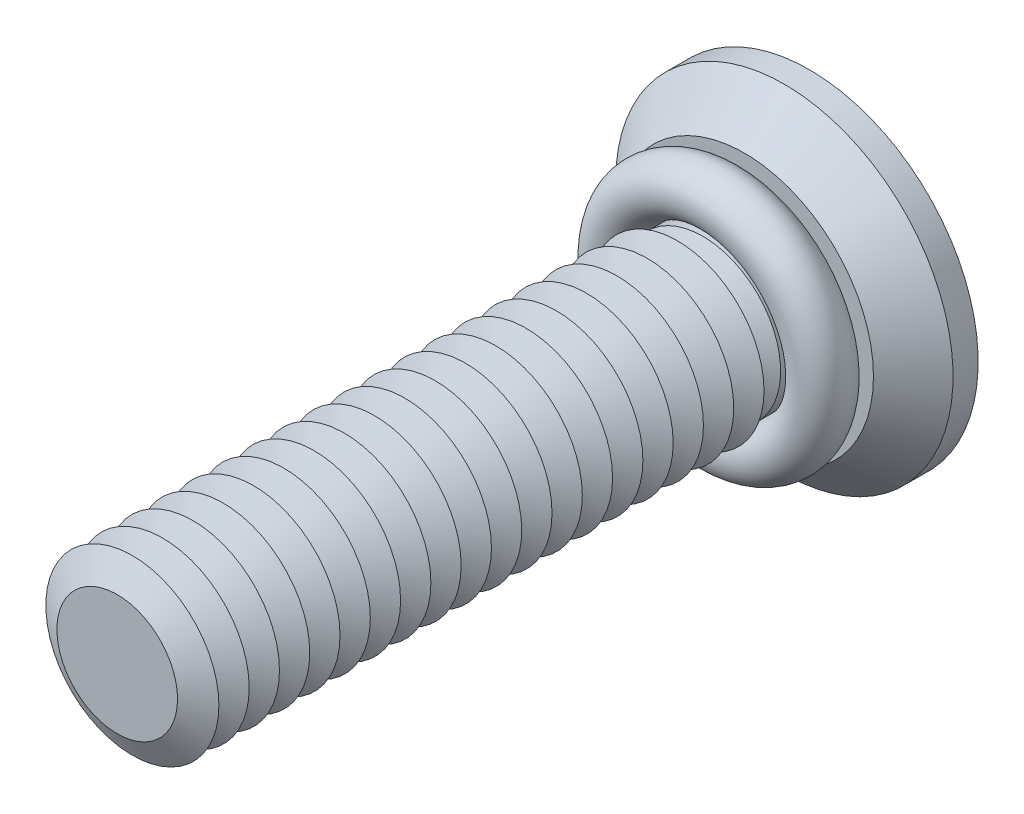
ISO-10303-21;
HEADER;
FILE_DESCRIPTION(('STEP AP214'),'2;1');
FILE_NAME('part.step','',(''),(''),'','','');
FILE_SCHEMA(('AUTOMOTIVE_DESIGN { 1 0 10303 214 1 1 1 1 }'));
ENDSEC;
DATA;
#1=APPLICATION_CONTEXT('core data for automotive mechanical design processes');
#2=APPLICATION_PROTOCOL_DEFINITION('international standard','automotive_design',2000,#1);
#3=PRODUCT_CONTEXT('',#1,'mechanical');
#4=PRODUCT('Part','Part','',(#3));
#5=PRODUCT_RELATED_PRODUCT_CATEGORY('part','',(#4));
#6=PRODUCT_DEFINITION_FORMATION('','',#4);
#7=PRODUCT_DEFINITION_CONTEXT('part definition',#1,'design');
#8=PRODUCT_DEFINITION('design','',#6,#7);
#9=PRODUCT_DEFINITION_SHAPE('','',#8);
#10=(LENGTH_UNIT() NAMED_UNIT(*) SI_UNIT(.MILLI.,.METRE.));
#11=(NAMED_UNIT(*) PLANE_ANGLE_UNIT() SI_UNIT($,.RADIAN.));
#12=(NAMED_UNIT(*) SI_UNIT($,.STERADIAN.) SOLID_ANGLE_UNIT());
#13=UNCERTAINTY_MEASURE_WITH_UNIT(LENGTH_MEASURE(1.E-05),#10,'distance_accuracy_value','');
#14=(GEOMETRIC_REPRESENTATION_CONTEXT(3) GLOBAL_UNCERTAINTY_ASSIGNED_CONTEXT((#13)) GLOBAL_UNIT_ASSIGNED_CONTEXT((#10,
#11,#12)) REPRESENTATION_CONTEXT('',''));
#15=CARTESIAN_POINT('',(0.,0.,0.));
#16=DIRECTION('',(0.,0.,1.));
#17=DIRECTION('',(1.,0.,0.));
#18=AXIS2_PLACEMENT_3D('',#15,#16,#17);
#19=CARTESIAN_POINT('',(0.,0.,2.1));
#20=DIRECTION('',(0.,0.,1.));
#21=DIRECTION('',(1.,0.,0.));
#22=AXIS2_PLACEMENT_3D('',#19,#20,#21);
#23=TOROIDAL_SURFACE('',#22,2.4,0.6);
#24=CARTESIAN_POINT('',(0.,2.4,2.1));
#25=DIRECTION('',(1.,0.,0.));
#26=DIRECTION('',(0.,0.,-1.));
#27=AXIS2_PLACEMENT_3D('',#24,#25,#26);
#28=CIRCLE('',#27,0.6);
#29=CARTESIAN_POINT('',(0.,3.,2.1));
#30=VERTEX_POINT('',#29);
#31=EDGE_CURVE('P0_E10',#30,#30,#28,.T.);
#32=CARTESIAN_POINT('',(0.,0.,2.1));
#33=DIRECTION('',(0.,0.,1.));
#34=DIRECTION('',(1.,0.,0.));
#35=AXIS2_PLACEMENT_3D('',#32,#33,#34);
#36=CIRCLE('',#35,3.);
#37=EDGE_CURVE('',#30,#30,#36,.T.);
#38=ORIENTED_EDGE('',*,*,#31,.F.);
#39=ORIENTED_EDGE('',*,*,#31,.T.);
#40=ORIENTED_EDGE('',*,*,#37,.T.);
#41=ORIENTED_EDGE('',*,*,#37,.F.);
#42=EDGE_LOOP('',(#38,#40,#39,#41));
#43=FACE_BOUND('',#42,.T.);
#44=ADVANCED_FACE('P0_F14',(#43),#23,.T.);
#45=CLOSED_SHELL('',(#44));
#46=MANIFOLD_SOLID_BREP('P0_B1',#45);
#47=CARTESIAN_POINT('',(0.,0.,12.5));
#48=DIRECTION('',(0.,0.,-1.));
#49=DIRECTION('',(-1.,0.,0.));
#50=AXIS2_PLACEMENT_3D('',#47,#48,#49);
#51=CONICAL_SURFACE('',#50,1.39378221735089,1.0471975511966);
#52=CARTESIAN_POINT('',(0.,0.,12.15));
#53=DIRECTION('',(0.,0.,1.));
#54=DIRECTION('',(1.,0.,0.));
#55=AXIS2_PLACEMENT_3D('',#52,#53,#54);
#56=CIRCLE('',#55,2.);
#57=CARTESIAN_POINT('',(2.,0.,12.15));
#58=VERTEX_POINT('',#57);
#59=EDGE_CURVE('P1_E324',#58,#58,#56,.T.);
#60=ORIENTED_EDGE('',*,*,#59,.T.);
#61=EDGE_LOOP('',(#60));
#62=FACE_BOUND('',#61,.T.);
#63=CARTESIAN_POINT('',(0.,0.,12.5));
#64=DIRECTION('',(0.,0.,1.));
#65=DIRECTION('',(1.,0.,0.));
#66=AXIS2_PLACEMENT_3D('',#63,#64,#65);
#67=CIRCLE('',#66,1.39378221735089);
#68=CARTESIAN_POINT('',(1.39378221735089,0.,12.5));
#69=VERTEX_POINT('',#68);
#70=EDGE_CURVE('P1_E321',#69,#69,#67,.T.);
#71=ORIENTED_EDGE('',*,*,#70,.F.);
#72=EDGE_LOOP('',(#71));
#73=FACE_BOUND('',#72,.T.);
#74=ADVANCED_FACE('P1_F15',(#62,#73),#51,.T.);
#75=CARTESIAN_POINT('',(0.,0.,12.85));
#76=DIRECTION('',(0.,0.,1.));
#77=DIRECTION('',(1.,0.,0.));
#78=AXIS2_PLACEMENT_3D('',#75,#76,#77);
#79=CONICAL_SURFACE('',#78,2.,1.0471975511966);
#80=ORIENTED_EDGE('',*,*,#70,.T.);
#81=EDGE_LOOP('',(#80));
#82=FACE_BOUND('',#81,.T.);
#83=CARTESIAN_POINT('',(0.,0.,12.85));
#84=DIRECTION('',(0.,0.,1.));
#85=DIRECTION('',(1.,0.,0.));
#86=AXIS2_PLACEMENT_3D('',#83,#84,#85);
#87=CIRCLE('',#86,2.);
#88=CARTESIAN_POINT('',(2.,0.,12.85));
#89=VERTEX_POINT('',#88);
#90=EDGE_CURVE('P1_E318',#89,#89,#87,.T.);
#91=ORIENTED_EDGE('',*,*,#90,.F.);
#92=EDGE_LOOP('',(#91));
#93=FACE_BOUND('',#92,.T.);
#94=ADVANCED_FACE('P1_F245',(#82,#93),#79,.T.);
#95=CARTESIAN_POINT('',(0.,0.,16.));
#96=DIRECTION('',(0.,0.,1.));
#97=DIRECTION('',(1.,0.,0.));
#98=AXIS2_PLACEMENT_3D('',#95,#96,#97);
#99=PLANE('',#98);
#100=CARTESIAN_POINT('',(0.,0.,16.));
#101=DIRECTION('',(0.,0.,1.));
#102=DIRECTION('',(1.,0.,0.));
#103=AXIS2_PLACEMENT_3D('',#100,#101,#102);
#104=CIRCLE('',#103,1.39378221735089);
#105=CARTESIAN_POINT('',(1.39378221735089,0.,16.));
#106=VERTEX_POINT('',#105);
#107=EDGE_CURVE('P1_E131',#106,#106,#104,.T.);
#108=ORIENTED_EDGE('',*,*,#107,.T.);
#109=EDGE_LOOP('',(#108));
#110=FACE_BOUND('',#109,.T.);
#111=ADVANCED_FACE('P1_F251',(#110),#99,.T.);
#112=CARTESIAN_POINT('',(0.,0.,16.));
#113=DIRECTION('',(0.,0.,-1.));
#114=DIRECTION('',(-1.,0.,0.));
#115=AXIS2_PLACEMENT_3D('',#112,#113,#114);
#116=CONICAL_SURFACE('',#115,1.39378221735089,1.0471975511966);
#117=CARTESIAN_POINT('',(0.,0.,15.65));
#118=DIRECTION('',(0.,0.,1.));
#119=DIRECTION('',(1.,0.,0.));
#120=AXIS2_PLACEMENT_3D('',#117,#118,#119);
#121=CIRCLE('',#120,2.);
#122=CARTESIAN_POINT('',(2.,0.,15.65));
#123=VERTEX_POINT('',#122);
#124=EDGE_CURVE('P1_E133',#123,#123,#121,.T.);
#125=ORIENTED_EDGE('',*,*,#124,.T.);
#126=EDGE_LOOP('',(#125));
#127=FACE_BOUND('',#126,.T.);
#128=ORIENTED_EDGE('',*,*,#107,.F.);
#129=EDGE_LOOP('',(#128));
#130=FACE_BOUND('',#129,.T.);
#131=ADVANCED_FACE('P1_F196',(#127,#130),#116,.T.);
#132=CARTESIAN_POINT('',(0.,0.,15.65));
#133=DIRECTION('',(0.,0.,1.));
#134=DIRECTION('',(1.,0.,0.));
#135=AXIS2_PLACEMENT_3D('',#132,#133,#134);
#136=CONICAL_SURFACE('',#135,2.,1.0471975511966);
#137=CARTESIAN_POINT('',(0.,0.,15.3));
#138=DIRECTION('',(0.,0.,1.));
#139=DIRECTION('',(1.,0.,0.));
#140=AXIS2_PLACEMENT_3D('',#137,#138,#139);
#141=CIRCLE('',#140,1.39378221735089);
#142=CARTESIAN_POINT('',(1.39378221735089,0.,15.3));
#143=VERTEX_POINT('',#142);
#144=EDGE_CURVE('P1_E297',#143,#143,#141,.T.);
#145=ORIENTED_EDGE('',*,*,#144,.T.);
#146=EDGE_LOOP('',(#145));
#147=FACE_BOUND('',#146,.T.);
#148=ORIENTED_EDGE('',*,*,#124,.F.);
#149=EDGE_LOOP('',(#148));
#150=FACE_BOUND('',#149,.T.);
#151=ADVANCED_FACE('P1_F284',(#147,#150),#136,.T.);
#152=CARTESIAN_POINT('',(0.,0.,15.3));
#153=DIRECTION('',(0.,0.,-1.));
#154=DIRECTION('',(-1.,0.,0.));
#155=AXIS2_PLACEMENT_3D('',#152,#153,#154);
#156=CONICAL_SURFACE('',#155,1.39378221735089,1.0471975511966);
#157=CARTESIAN_POINT('',(0.,0.,14.95));
#158=DIRECTION('',(0.,0.,1.));
#159=DIRECTION('',(1.,0.,0.));
#160=AXIS2_PLACEMENT_3D('',#157,#158,#159);
#161=CIRCLE('',#160,2.);
#162=CARTESIAN_POINT('',(2.,0.,14.95));
#163=VERTEX_POINT('',#162);
#164=EDGE_CURVE('P1_E294',#163,#163,#161,.T.);
#165=ORIENTED_EDGE('',*,*,#164,.T.);
#166=EDGE_LOOP('',(#165));
#167=FACE_BOUND('',#166,.T.);
#168=ORIENTED_EDGE('',*,*,#144,.F.);
#169=EDGE_LOOP('',(#168));
#170=FACE_BOUND('',#169,.T.);
#171=ADVANCED_FACE('P1_F279',(#167,#170),#156,.T.);
#172=CARTESIAN_POINT('',(0.,0.,14.95));
#173=DIRECTION('',(0.,0.,1.));
#174=DIRECTION('',(1.,0.,0.));
#175=AXIS2_PLACEMENT_3D('',#172,#173,#174);
#176=CONICAL_SURFACE('',#175,2.,1.0471975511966);
#177=CARTESIAN_POINT('',(0.,0.,14.6));
#178=DIRECTION('',(0.,0.,1.));
#179=DIRECTION('',(1.,0.,0.));
#180=AXIS2_PLACEMENT_3D('',#177,#178,#179);
#181=CIRCLE('',#180,1.39378221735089);
#182=CARTESIAN_POINT('',(1.39378221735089,0.,14.6));
#183=VERTEX_POINT('',#182);
#184=EDGE_CURVE('P1_E301',#183,#183,#181,.T.);
#185=ORIENTED_EDGE('',*,*,#184,.T.);
#186=EDGE_LOOP('',(#185));
#187=FACE_BOUND('',#186,.T.);
#188=ORIENTED_EDGE('',*,*,#164,.F.);
#189=EDGE_LOOP('',(#188));
#190=FACE_BOUND('',#189,.T.);
#191=ADVANCED_FACE('P1_F276',(#187,#190),#176,.T.);
#192=CARTESIAN_POINT('',(0.,0.,14.6));
#193=DIRECTION('',(0.,0.,-1.));
#194=DIRECTION('',(-1.,0.,0.));
#195=AXIS2_PLACEMENT_3D('',#192,#193,#194);
#196=CONICAL_SURFACE('',#195,1.39378221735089,1.0471975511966);
#197=CARTESIAN_POINT('',(0.,0.,14.25));
#198=DIRECTION('',(0.,0.,1.));
#199=DIRECTION('',(1.,0.,0.));
#200=AXIS2_PLACEMENT_3D('',#197,#198,#199);
#201=CIRCLE('',#200,2.);
#202=CARTESIAN_POINT('',(2.,0.,14.25));
#203=VERTEX_POINT('',#202);
#204=EDGE_CURVE('P1_E306',#203,#203,#201,.T.);
#205=ORIENTED_EDGE('',*,*,#204,.T.);
#206=EDGE_LOOP('',(#205));
#207=FACE_BOUND('',#206,.T.);
#208=ORIENTED_EDGE('',*,*,#184,.F.);
#209=EDGE_LOOP('',(#208));
#210=FACE_BOUND('',#209,.T.);
#211=ADVANCED_FACE('P1_F271',(#207,#210),#196,.T.);
#212=CARTESIAN_POINT('',(0.,0.,14.25));
#213=DIRECTION('',(0.,0.,1.));
#214=DIRECTION('',(1.,0.,0.));
#215=AXIS2_PLACEMENT_3D('',#212,#213,#214);
#216=CONICAL_SURFACE('',#215,2.,1.0471975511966);
#217=CARTESIAN_POINT('',(0.,0.,13.9));
#218=DIRECTION('',(0.,0.,1.));
#219=DIRECTION('',(1.,0.,0.));
#220=AXIS2_PLACEMENT_3D('',#217,#218,#219);
#221=CIRCLE('',#220,1.39378221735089);
#222=CARTESIAN_POINT('',(1.39378221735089,0.,13.9));
#223=VERTEX_POINT('',#222);
#224=EDGE_CURVE('P1_E309',#223,#223,#221,.T.);
#225=ORIENTED_EDGE('',*,*,#224,.T.);
#226=EDGE_LOOP('',(#225));
#227=FACE_BOUND('',#226,.T.);
#228=ORIENTED_EDGE('',*,*,#204,.F.);
#229=EDGE_LOOP('',(#228));
#230=FACE_BOUND('',#229,.T.);
#231=ADVANCED_FACE('P1_F268',(#227,#230),#216,.T.);
#232=CARTESIAN_POINT('',(0.,0.,13.9));
#233=DIRECTION('',(0.,0.,-1.));
#234=DIRECTION('',(-1.,0.,0.));
#235=AXIS2_PLACEMENT_3D('',#232,#233,#234);
#236=CONICAL_SURFACE('',#235,1.39378221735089,1.0471975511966);
#237=CARTESIAN_POINT('',(0.,0.,13.55));
#238=DIRECTION('',(0.,0.,1.));
#239=DIRECTION('',(1.,0.,0.));
#240=AXIS2_PLACEMENT_3D('',#237,#238,#239);
#241=CIRCLE('',#240,2.);
#242=CARTESIAN_POINT('',(2.,0.,13.55));
#243=VERTEX_POINT('',#242);
#244=EDGE_CURVE('P1_E312',#243,#243,#241,.T.);
#245=ORIENTED_EDGE('',*,*,#244,.T.);
#246=EDGE_LOOP('',(#245));
#247=FACE_BOUND('',#246,.T.);
#248=ORIENTED_EDGE('',*,*,#224,.F.);
#249=EDGE_LOOP('',(#248));
#250=FACE_BOUND('',#249,.T.);
#251=ADVANCED_FACE('P1_F262',(#247,#250),#236,.T.);
#252=CARTESIAN_POINT('',(0.,0.,13.55));
#253=DIRECTION('',(0.,0.,1.));
#254=DIRECTION('',(1.,0.,0.));
#255=AXIS2_PLACEMENT_3D('',#252,#253,#254);
#256=CONICAL_SURFACE('',#255,2.,1.0471975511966);
#257=CARTESIAN_POINT('',(0.,0.,13.2));
#258=DIRECTION('',(0.,0.,1.));
#259=DIRECTION('',(1.,0.,0.));
#260=AXIS2_PLACEMENT_3D('',#257,#258,#259);
#261=CIRCLE('',#260,1.39378221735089);
#262=CARTESIAN_POINT('',(1.39378221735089,0.,13.2));
#263=VERTEX_POINT('',#262);
#264=EDGE_CURVE('P1_E315',#263,#263,#261,.T.);
#265=ORIENTED_EDGE('',*,*,#264,.T.);
#266=EDGE_LOOP('',(#265));
#267=FACE_BOUND('',#266,.T.);
#268=ORIENTED_EDGE('',*,*,#244,.F.);
#269=EDGE_LOOP('',(#268));
#270=FACE_BOUND('',#269,.T.);
#271=ADVANCED_FACE('P1_F258',(#267,#270),#256,.T.);
#272=CARTESIAN_POINT('',(0.,0.,13.2));
#273=DIRECTION('',(0.,0.,-1.));
#274=DIRECTION('',(-1.,0.,0.));
#275=AXIS2_PLACEMENT_3D('',#272,#273,#274);
#276=CONICAL_SURFACE('',#275,1.39378221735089,1.0471975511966);
#277=ORIENTED_EDGE('',*,*,#90,.T.);
#278=EDGE_LOOP('',(#277));
#279=FACE_BOUND('',#278,.T.);
#280=ORIENTED_EDGE('',*,*,#264,.F.);
#281=EDGE_LOOP('',(#280));
#282=FACE_BOUND('',#281,.T.);
#283=ADVANCED_FACE('P1_F261',(#279,#282),#276,.T.);
#284=CARTESIAN_POINT('',(0.,0.,11.8));
#285=DIRECTION('',(0.,0.,-1.));
#286=DIRECTION('',(-1.,0.,0.));
#287=AXIS2_PLACEMENT_3D('',#284,#285,#286);
#288=CONICAL_SURFACE('',#287,1.39378221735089,1.0471975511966);
#289=CARTESIAN_POINT('',(0.,0.,11.45));
#290=DIRECTION('',(0.,0.,1.));
#291=DIRECTION('',(1.,0.,0.));
#292=AXIS2_PLACEMENT_3D('',#289,#290,#291);
#293=CIRCLE('',#292,2.);
#294=CARTESIAN_POINT('',(2.,0.,11.45));
#295=VERTEX_POINT('',#294);
#296=EDGE_CURVE('P1_E329',#295,#295,#293,.T.);
#297=ORIENTED_EDGE('',*,*,#296,.T.);
#298=EDGE_LOOP('',(#297));
#299=FACE_BOUND('',#298,.T.);
#300=CARTESIAN_POINT('',(0.,0.,11.8));
#301=DIRECTION('',(0.,0.,1.));
#302=DIRECTION('',(1.,0.,0.));
#303=AXIS2_PLACEMENT_3D('',#300,#301,#302);
#304=CIRCLE('',#303,1.39378221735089);
#305=CARTESIAN_POINT('',(1.39378221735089,0.,11.8));
#306=VERTEX_POINT('',#305);
#307=EDGE_CURVE('P1_E326',#306,#306,#304,.T.);
#308=ORIENTED_EDGE('',*,*,#307,.F.);
#309=EDGE_LOOP('',(#308));
#310=FACE_BOUND('',#309,.T.);
#311=ADVANCED_FACE('P1_F266',(#299,#310),#288,.T.);
#312=CARTESIAN_POINT('',(0.,0.,12.15));
#313=DIRECTION('',(0.,0.,1.));
#314=DIRECTION('',(1.,0.,0.));
#315=AXIS2_PLACEMENT_3D('',#312,#313,#314);
#316=CONICAL_SURFACE('',#315,2.,1.0471975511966);
#317=ORIENTED_EDGE('',*,*,#307,.T.);
#318=EDGE_LOOP('',(#317));
#319=FACE_BOUND('',#318,.T.);
#320=ORIENTED_EDGE('',*,*,#59,.F.);
#321=EDGE_LOOP('',(#320));
#322=FACE_BOUND('',#321,.T.);
#323=ADVANCED_FACE('P1_F509',(#319,#322),#316,.T.);
#324=CARTESIAN_POINT('',(0.,0.,11.1));
#325=DIRECTION('',(0.,0.,-1.));
#326=DIRECTION('',(-1.,0.,0.));
#327=AXIS2_PLACEMENT_3D('',#324,#325,#326);
#328=CONICAL_SURFACE('',#327,1.39378221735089,1.0471975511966);
#329=CARTESIAN_POINT('',(0.,0.,10.75));
#330=DIRECTION('',(0.,0.,1.));
#331=DIRECTION('',(1.,0.,0.));
#332=AXIS2_PLACEMENT_3D('',#329,#330,#331);
#333=CIRCLE('',#332,2.);
#334=CARTESIAN_POINT('',(2.,0.,10.75));
#335=VERTEX_POINT('',#334);
#336=EDGE_CURVE('P1_E335',#335,#335,#333,.T.);
#337=ORIENTED_EDGE('',*,*,#336,.T.);
#338=EDGE_LOOP('',(#337));
#339=FACE_BOUND('',#338,.T.);
#340=CARTESIAN_POINT('',(0.,0.,11.1));
#341=DIRECTION('',(0.,0.,1.));
#342=DIRECTION('',(1.,0.,0.));
#343=AXIS2_PLACEMENT_3D('',#340,#341,#342);
#344=CIRCLE('',#343,1.39378221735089);
#345=CARTESIAN_POINT('',(1.39378221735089,0.,11.1));
#346=VERTEX_POINT('',#345);
#347=EDGE_CURVE('P1_E332',#346,#346,#344,.T.);
#348=ORIENTED_EDGE('',*,*,#347,.F.);
#349=EDGE_LOOP('',(#348));
#350=FACE_BOUND('',#349,.T.);
#351=ADVANCED_FACE('P1_F518',(#339,#350),#328,.T.);
#352=CARTESIAN_POINT('',(0.,0.,11.45));
#353=DIRECTION('',(0.,0.,1.));
#354=DIRECTION('',(1.,0.,0.));
#355=AXIS2_PLACEMENT_3D('',#352,#353,#354);
#356=CONICAL_SURFACE('',#355,2.,1.0471975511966);
#357=ORIENTED_EDGE('',*,*,#347,.T.);
#358=EDGE_LOOP('',(#357));
#359=FACE_BOUND('',#358,.T.);
#360=ORIENTED_EDGE('',*,*,#296,.F.);
#361=EDGE_LOOP('',(#360));
#362=FACE_BOUND('',#361,.T.);
#363=ADVANCED_FACE('P1_F528',(#359,#362),#356,.T.);
#364=CARTESIAN_POINT('',(0.,0.,10.4));
#365=DIRECTION('',(0.,0.,-1.));
#366=DIRECTION('',(-1.,0.,0.));
#367=AXIS2_PLACEMENT_3D('',#364,#365,#366);
#368=CONICAL_SURFACE('',#367,1.39378221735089,1.0471975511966);
#369=CARTESIAN_POINT('',(0.,0.,10.05));
#370=DIRECTION('',(0.,0.,1.));
#371=DIRECTION('',(1.,0.,0.));
#372=AXIS2_PLACEMENT_3D('',#369,#370,#371);
#373=CIRCLE('',#372,2.);
#374=CARTESIAN_POINT('',(2.,0.,10.05));
#375=VERTEX_POINT('',#374);
#376=EDGE_CURVE('P1_E341',#375,#375,#373,.T.);
#377=ORIENTED_EDGE('',*,*,#376,.T.);
#378=EDGE_LOOP('',(#377));
#379=FACE_BOUND('',#378,.T.);
#380=CARTESIAN_POINT('',(0.,0.,10.4));
#381=DIRECTION('',(0.,0.,1.));
#382=DIRECTION('',(1.,0.,0.));
#383=AXIS2_PLACEMENT_3D('',#380,#381,#382);
#384=CIRCLE('',#383,1.39378221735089);
#385=CARTESIAN_POINT('',(1.39378221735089,0.,10.4));
#386=VERTEX_POINT('',#385);
#387=EDGE_CURVE('P1_E338',#386,#386,#384,.T.);
#388=ORIENTED_EDGE('',*,*,#387,.F.);
#389=EDGE_LOOP('',(#388));
#390=FACE_BOUND('',#389,.T.);
#391=ADVANCED_FACE('P1_F538',(#379,#390),#368,.T.);
#392=CARTESIAN_POINT('',(0.,0.,10.75));
#393=DIRECTION('',(0.,0.,1.));
#394=DIRECTION('',(1.,0.,0.));
#395=AXIS2_PLACEMENT_3D('',#392,#393,#394);
#396=CONICAL_SURFACE('',#395,2.,1.0471975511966);
#397=ORIENTED_EDGE('',*,*,#387,.T.);
#398=EDGE_LOOP('',(#397));
#399=FACE_BOUND('',#398,.T.);
#400=ORIENTED_EDGE('',*,*,#336,.F.);
#401=EDGE_LOOP('',(#400));
#402=FACE_BOUND('',#401,.T.);
#403=ADVANCED_FACE('P1_F548',(#399,#402),#396,.T.);
#404=CARTESIAN_POINT('',(0.,0.,9.7));
#405=DIRECTION('',(0.,0.,-1.));
#406=DIRECTION('',(-1.,0.,0.));
#407=AXIS2_PLACEMENT_3D('',#404,#405,#406);
#408=CONICAL_SURFACE('',#407,1.39378221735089,1.0471975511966);
#409=CARTESIAN_POINT('',(0.,0.,9.35));
#410=DIRECTION('',(0.,0.,1.));
#411=DIRECTION('',(1.,0.,0.));
#412=AXIS2_PLACEMENT_3D('',#409,#410,#411);
#413=CIRCLE('',#412,2.);
#414=CARTESIAN_POINT('',(2.,0.,9.35));
#415=VERTEX_POINT('',#414);
#416=EDGE_CURVE('P1_E347',#415,#415,#413,.T.);
#417=ORIENTED_EDGE('',*,*,#416,.T.);
#418=EDGE_LOOP('',(#417));
#419=FACE_BOUND('',#418,.T.);
#420=CARTESIAN_POINT('',(0.,0.,9.7));
#421=DIRECTION('',(0.,0.,1.));
#422=DIRECTION('',(1.,0.,0.));
#423=AXIS2_PLACEMENT_3D('',#420,#421,#422);
#424=CIRCLE('',#423,1.39378221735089);
#425=CARTESIAN_POINT('',(1.39378221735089,0.,9.7));
#426=VERTEX_POINT('',#425);
#427=EDGE_CURVE('P1_E344',#426,#426,#424,.T.);
#428=ORIENTED_EDGE('',*,*,#427,.F.);
#429=EDGE_LOOP('',(#428));
#430=FACE_BOUND('',#429,.T.);
#431=ADVANCED_FACE('P1_F558',(#419,#430),#408,.T.);
#432=CARTESIAN_POINT('',(0.,0.,10.05));
#433=DIRECTION('',(0.,0.,1.));
#434=DIRECTION('',(1.,0.,0.));
#435=AXIS2_PLACEMENT_3D('',#432,#433,#434);
#436=CONICAL_SURFACE('',#435,2.,1.0471975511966);
#437=ORIENTED_EDGE('',*,*,#427,.T.);
#438=EDGE_LOOP('',(#437));
#439=FACE_BOUND('',#438,.T.);
#440=ORIENTED_EDGE('',*,*,#376,.F.);
#441=EDGE_LOOP('',(#440));
#442=FACE_BOUND('',#441,.T.);
#443=ADVANCED_FACE('P1_F568',(#439,#442),#436,.T.);
#444=CARTESIAN_POINT('',(0.,0.,9.));
#445=DIRECTION('',(0.,0.,-1.));
#446=DIRECTION('',(-1.,0.,0.));
#447=AXIS2_PLACEMENT_3D('',#444,#445,#446);
#448=CONICAL_SURFACE('',#447,1.39378221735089,1.0471975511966);
#449=CARTESIAN_POINT('',(0.,0.,8.65));
#450=DIRECTION('',(0.,0.,1.));
#451=DIRECTION('',(1.,0.,0.));
#452=AXIS2_PLACEMENT_3D('',#449,#450,#451);
#453=CIRCLE('',#452,2.);
#454=CARTESIAN_POINT('',(2.,0.,8.65));
#455=VERTEX_POINT('',#454);
#456=EDGE_CURVE('P1_E353',#455,#455,#453,.T.);
#457=ORIENTED_EDGE('',*,*,#456,.T.);
#458=EDGE_LOOP('',(#457));
#459=FACE_BOUND('',#458,.T.);
#460=CARTESIAN_POINT('',(0.,0.,9.));
#461=DIRECTION('',(0.,0.,1.));
#462=DIRECTION('',(1.,0.,0.));
#463=AXIS2_PLACEMENT_3D('',#460,#461,#462);
#464=CIRCLE('',#463,1.39378221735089);
#465=CARTESIAN_POINT('',(1.39378221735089,0.,9.));
#466=VERTEX_POINT('',#465);
#467=EDGE_CURVE('P1_E350',#466,#466,#464,.T.);
#468=ORIENTED_EDGE('',*,*,#467,.F.);
#469=EDGE_LOOP('',(#468));
#470=FACE_BOUND('',#469,.T.);
#471=ADVANCED_FACE('P1_F578',(#459,#470),#448,.T.);
#472=CARTESIAN_POINT('',(0.,0.,9.35));
#473=DIRECTION('',(0.,0.,1.));
#474=DIRECTION('',(1.,0.,0.));
#475=AXIS2_PLACEMENT_3D('',#472,#473,#474);
#476=CONICAL_SURFACE('',#475,2.,1.0471975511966);
#477=ORIENTED_EDGE('',*,*,#467,.T.);
#478=EDGE_LOOP('',(#477));
#479=FACE_BOUND('',#478,.T.);
#480=ORIENTED_EDGE('',*,*,#416,.F.);
#481=EDGE_LOOP('',(#480));
#482=FACE_BOUND('',#481,.T.);
#483=ADVANCED_FACE('P1_F588',(#479,#482),#476,.T.);
#484=CARTESIAN_POINT('',(0.,0.,8.3));
#485=DIRECTION('',(0.,0.,-1.));
#486=DIRECTION('',(-1.,0.,0.));
#487=AXIS2_PLACEMENT_3D('',#484,#485,#486);
#488=CONICAL_SURFACE('',#487,1.39378221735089,1.0471975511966);
#489=CARTESIAN_POINT('',(0.,0.,7.95));
#490=DIRECTION('',(0.,0.,1.));
#491=DIRECTION('',(1.,0.,0.));
#492=AXIS2_PLACEMENT_3D('',#489,#490,#491);
#493=CIRCLE('',#492,2.);
#494=CARTESIAN_POINT('',(2.,0.,7.95));
#495=VERTEX_POINT('',#494);
#496=EDGE_CURVE('P1_E359',#495,#495,#493,.T.);
#497=ORIENTED_EDGE('',*,*,#496,.T.);
#498=EDGE_LOOP('',(#497));
#499=FACE_BOUND('',#498,.T.);
#500=CARTESIAN_POINT('',(0.,0.,8.3));
#501=DIRECTION('',(0.,0.,1.));
#502=DIRECTION('',(1.,0.,0.));
#503=AXIS2_PLACEMENT_3D('',#500,#501,#502);
#504=CIRCLE('',#503,1.39378221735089);
#505=CARTESIAN_POINT('',(1.39378221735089,0.,8.3));
#506=VERTEX_POINT('',#505);
#507=EDGE_CURVE('P1_E356',#506,#506,#504,.T.);
#508=ORIENTED_EDGE('',*,*,#507,.F.);
#509=EDGE_LOOP('',(#508));
#510=FACE_BOUND('',#509,.T.);
#511=ADVANCED_FACE('P1_F598',(#499,#510),#488,.T.);
#512=CARTESIAN_POINT('',(0.,0.,8.65));
#513=DIRECTION('',(0.,0.,1.));
#514=DIRECTION('',(1.,0.,0.));
#515=AXIS2_PLACEMENT_3D('',#512,#513,#514);
#516=CONICAL_SURFACE('',#515,2.,1.0471975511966);
#517=ORIENTED_EDGE('',*,*,#507,.T.);
#518=EDGE_LOOP('',(#517));
#519=FACE_BOUND('',#518,.T.);
#520=ORIENTED_EDGE('',*,*,#456,.F.);
#521=EDGE_LOOP('',(#520));
#522=FACE_BOUND('',#521,.T.);
#523=ADVANCED_FACE('P1_F608',(#519,#522),#516,.T.);
#524=CARTESIAN_POINT('',(0.,0.,7.6));
#525=DIRECTION('',(0.,0.,-1.));
#526=DIRECTION('',(-1.,0.,0.));
#527=AXIS2_PLACEMENT_3D('',#524,#525,#526);
#528=CONICAL_SURFACE('',#527,1.39378221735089,1.0471975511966);
#529=CARTESIAN_POINT('',(0.,0.,7.25));
#530=DIRECTION('',(0.,0.,1.));
#531=DIRECTION('',(1.,0.,0.));
#532=AXIS2_PLACEMENT_3D('',#529,#530,#531);
#533=CIRCLE('',#532,2.);
#534=CARTESIAN_POINT('',(2.,0.,7.25));
#535=VERTEX_POINT('',#534);
#536=EDGE_CURVE('P1_E365',#535,#535,#533,.T.);
#537=ORIENTED_EDGE('',*,*,#536,.T.);
#538=EDGE_LOOP('',(#537));
#539=FACE_BOUND('',#538,.T.);
#540=CARTESIAN_POINT('',(0.,0.,7.6));
#541=DIRECTION('',(0.,0.,1.));
#542=DIRECTION('',(1.,0.,0.));
#543=AXIS2_PLACEMENT_3D('',#540,#541,#542);
#544=CIRCLE('',#543,1.39378221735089);
#545=CARTESIAN_POINT('',(1.39378221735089,0.,7.6));
#546=VERTEX_POINT('',#545);
#547=EDGE_CURVE('P1_E362',#546,#546,#544,.T.);
#548=ORIENTED_EDGE('',*,*,#547,.F.);
#549=EDGE_LOOP('',(#548));
#550=FACE_BOUND('',#549,.T.);
#551=ADVANCED_FACE('P1_F618',(#539,#550),#528,.T.);
#552=CARTESIAN_POINT('',(0.,0.,7.95));
#553=DIRECTION('',(0.,0.,1.));
#554=DIRECTION('',(1.,0.,0.));
#555=AXIS2_PLACEMENT_3D('',#552,#553,#554);
#556=CONICAL_SURFACE('',#555,2.,1.0471975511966);
#557=ORIENTED_EDGE('',*,*,#547,.T.);
#558=EDGE_LOOP('',(#557));
#559=FACE_BOUND('',#558,.T.);
#560=ORIENTED_EDGE('',*,*,#496,.F.);
#561=EDGE_LOOP('',(#560));
#562=FACE_BOUND('',#561,.T.);
#563=ADVANCED_FACE('P1_F628',(#559,#562),#556,.T.);
#564=CARTESIAN_POINT('',(0.,0.,6.9));
#565=DIRECTION('',(0.,0.,-1.));
#566=DIRECTION('',(-1.,0.,0.));
#567=AXIS2_PLACEMENT_3D('',#564,#565,#566);
#568=CONICAL_SURFACE('',#567,1.39378221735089,1.0471975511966);
#569=CARTESIAN_POINT('',(0.,0.,6.55));
#570=DIRECTION('',(0.,0.,1.));
#571=DIRECTION('',(1.,0.,0.));
#572=AXIS2_PLACEMENT_3D('',#569,#570,#571);
#573=CIRCLE('',#572,2.);
#574=CARTESIAN_POINT('',(2.,0.,6.55));
#575=VERTEX_POINT('',#574);
#576=EDGE_CURVE('P1_E371',#575,#575,#573,.T.);
#577=ORIENTED_EDGE('',*,*,#576,.T.);
#578=EDGE_LOOP('',(#577));
#579=FACE_BOUND('',#578,.T.);
#580=CARTESIAN_POINT('',(0.,0.,6.9));
#581=DIRECTION('',(0.,0.,1.));
#582=DIRECTION('',(1.,0.,0.));
#583=AXIS2_PLACEMENT_3D('',#580,#581,#582);
#584=CIRCLE('',#583,1.39378221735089);
#585=CARTESIAN_POINT('',(1.39378221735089,0.,6.9));
#586=VERTEX_POINT('',#585);
#587=EDGE_CURVE('P1_E368',#586,#586,#584,.T.);
#588=ORIENTED_EDGE('',*,*,#587,.F.);
#589=EDGE_LOOP('',(#588));
#590=FACE_BOUND('',#589,.T.);
#591=ADVANCED_FACE('P1_F638',(#579,#590),#568,.T.);
#592=CARTESIAN_POINT('',(0.,0.,7.25));
#593=DIRECTION('',(0.,0.,1.));
#594=DIRECTION('',(1.,0.,0.));
#595=AXIS2_PLACEMENT_3D('',#592,#593,#594);
#596=CONICAL_SURFACE('',#595,2.,1.0471975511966);
#597=ORIENTED_EDGE('',*,*,#587,.T.);
#598=EDGE_LOOP('',(#597));
#599=FACE_BOUND('',#598,.T.);
#600=ORIENTED_EDGE('',*,*,#536,.F.);
#601=EDGE_LOOP('',(#600));
#602=FACE_BOUND('',#601,.T.);
#603=ADVANCED_FACE('P1_F648',(#599,#602),#596,.T.);
#604=CARTESIAN_POINT('',(0.,0.,6.2));
#605=DIRECTION('',(0.,0.,-1.));
#606=DIRECTION('',(-1.,0.,0.));
#607=AXIS2_PLACEMENT_3D('',#604,#605,#606);
#608=CONICAL_SURFACE('',#607,1.39378221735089,1.0471975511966);
#609=CARTESIAN_POINT('',(0.,0.,5.85));
#610=DIRECTION('',(0.,0.,1.));
#611=DIRECTION('',(1.,0.,0.));
#612=AXIS2_PLACEMENT_3D('',#609,#610,#611);
#613=CIRCLE('',#612,2.);
#614=CARTESIAN_POINT('',(2.,0.,5.85));
#615=VERTEX_POINT('',#614);
#616=EDGE_CURVE('P1_E377',#615,#615,#613,.T.);
#617=ORIENTED_EDGE('',*,*,#616,.T.);
#618=EDGE_LOOP('',(#617));
#619=FACE_BOUND('',#618,.T.);
#620=CARTESIAN_POINT('',(0.,0.,6.2));
#621=DIRECTION('',(0.,0.,1.));
#622=DIRECTION('',(1.,0.,0.));
#623=AXIS2_PLACEMENT_3D('',#620,#621,#622);
#624=CIRCLE('',#623,1.39378221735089);
#625=CARTESIAN_POINT('',(1.39378221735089,0.,6.2));
#626=VERTEX_POINT('',#625);
#627=EDGE_CURVE('P1_E374',#626,#626,#624,.T.);
#628=ORIENTED_EDGE('',*,*,#627,.F.);
#629=EDGE_LOOP('',(#628));
#630=FACE_BOUND('',#629,.T.);
#631=ADVANCED_FACE('P1_F658',(#619,#630),#608,.T.);
#632=CARTESIAN_POINT('',(0.,0.,6.55));
#633=DIRECTION('',(0.,0.,1.));
#634=DIRECTION('',(1.,0.,0.));
#635=AXIS2_PLACEMENT_3D('',#632,#633,#634);
#636=CONICAL_SURFACE('',#635,2.,1.0471975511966);
#637=ORIENTED_EDGE('',*,*,#627,.T.);
#638=EDGE_LOOP('',(#637));
#639=FACE_BOUND('',#638,.T.);
#640=ORIENTED_EDGE('',*,*,#576,.F.);
#641=EDGE_LOOP('',(#640));
#642=FACE_BOUND('',#641,.T.);
#643=ADVANCED_FACE('P1_F668',(#639,#642),#636,.T.);
#644=CARTESIAN_POINT('',(0.,0.,5.5));
#645=DIRECTION('',(0.,0.,-1.));
#646=DIRECTION('',(-1.,0.,0.));
#647=AXIS2_PLACEMENT_3D('',#644,#645,#646);
#648=CONICAL_SURFACE('',#647,1.39378221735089,1.0471975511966);
#649=CARTESIAN_POINT('',(0.,0.,5.15));
#650=DIRECTION('',(0.,0.,1.));
#651=DIRECTION('',(1.,0.,0.));
#652=AXIS2_PLACEMENT_3D('',#649,#650,#651);
#653=CIRCLE('',#652,2.);
#654=CARTESIAN_POINT('',(2.,0.,5.15));
#655=VERTEX_POINT('',#654);
#656=EDGE_CURVE('P1_E383',#655,#655,#653,.T.);
#657=ORIENTED_EDGE('',*,*,#656,.T.);
#658=EDGE_LOOP('',(#657));
#659=FACE_BOUND('',#658,.T.);
#660=CARTESIAN_POINT('',(0.,0.,5.5));
#661=DIRECTION('',(0.,0.,1.));
#662=DIRECTION('',(1.,0.,0.));
#663=AXIS2_PLACEMENT_3D('',#660,#661,#662);
#664=CIRCLE('',#663,1.39378221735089);
#665=CARTESIAN_POINT('',(1.39378221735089,0.,5.5));
#666=VERTEX_POINT('',#665);
#667=EDGE_CURVE('P1_E380',#666,#666,#664,.T.);
#668=ORIENTED_EDGE('',*,*,#667,.F.);
#669=EDGE_LOOP('',(#668));
#670=FACE_BOUND('',#669,.T.);
#671=ADVANCED_FACE('P1_F678',(#659,#670),#648,.T.);
#672=CARTESIAN_POINT('',(0.,0.,5.85));
#673=DIRECTION('',(0.,0.,1.));
#674=DIRECTION('',(1.,0.,0.));
#675=AXIS2_PLACEMENT_3D('',#672,#673,#674);
#676=CONICAL_SURFACE('',#675,2.,1.0471975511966);
#677=ORIENTED_EDGE('',*,*,#667,.T.);
#678=EDGE_LOOP('',(#677));
#679=FACE_BOUND('',#678,.T.);
#680=ORIENTED_EDGE('',*,*,#616,.F.);
#681=EDGE_LOOP('',(#680));
#682=FACE_BOUND('',#681,.T.);
#683=ADVANCED_FACE('P1_F688',(#679,#682),#676,.T.);
#684=CARTESIAN_POINT('',(0.,0.,4.8));
#685=DIRECTION('',(0.,0.,-1.));
#686=DIRECTION('',(-1.,0.,0.));
#687=AXIS2_PLACEMENT_3D('',#684,#685,#686);
#688=CONICAL_SURFACE('',#687,1.39378221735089,1.0471975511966);
#689=CARTESIAN_POINT('',(0.,0.,4.45));
#690=DIRECTION('',(0.,0.,1.));
#691=DIRECTION('',(1.,0.,0.));
#692=AXIS2_PLACEMENT_3D('',#689,#690,#691);
#693=CIRCLE('',#692,2.);
#694=CARTESIAN_POINT('',(2.,0.,4.45));
#695=VERTEX_POINT('',#694);
#696=EDGE_CURVE('P1_E389',#695,#695,#693,.T.);
#697=ORIENTED_EDGE('',*,*,#696,.T.);
#698=EDGE_LOOP('',(#697));
#699=FACE_BOUND('',#698,.T.);
#700=CARTESIAN_POINT('',(0.,0.,4.8));
#701=DIRECTION('',(0.,0.,1.));
#702=DIRECTION('',(1.,0.,0.));
#703=AXIS2_PLACEMENT_3D('',#700,#701,#702);
#704=CIRCLE('',#703,1.39378221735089);
#705=CARTESIAN_POINT('',(1.39378221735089,0.,4.8));
#706=VERTEX_POINT('',#705);
#707=EDGE_CURVE('P1_E386',#706,#706,#704,.T.);
#708=ORIENTED_EDGE('',*,*,#707,.F.);
#709=EDGE_LOOP('',(#708));
#710=FACE_BOUND('',#709,.T.);
#711=ADVANCED_FACE('P1_F698',(#699,#710),#688,.T.);
#712=CARTESIAN_POINT('',(0.,0.,5.15));
#713=DIRECTION('',(0.,0.,1.));
#714=DIRECTION('',(1.,0.,0.));
#715=AXIS2_PLACEMENT_3D('',#712,#713,#714);
#716=CONICAL_SURFACE('',#715,2.,1.0471975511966);
#717=ORIENTED_EDGE('',*,*,#707,.T.);
#718=EDGE_LOOP('',(#717));
#719=FACE_BOUND('',#718,.T.);
#720=ORIENTED_EDGE('',*,*,#656,.F.);
#721=EDGE_LOOP('',(#720));
#722=FACE_BOUND('',#721,.T.);
#723=ADVANCED_FACE('P1_F708',(#719,#722),#716,.T.);
#724=CARTESIAN_POINT('',(0.,0.,4.1));
#725=DIRECTION('',(0.,0.,-1.));
#726=DIRECTION('',(-1.,0.,0.));
#727=AXIS2_PLACEMENT_3D('',#724,#725,#726);
#728=CONICAL_SURFACE('',#727,1.39378221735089,1.0471975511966);
#729=CARTESIAN_POINT('',(0.,0.,3.75));
#730=DIRECTION('',(0.,0.,1.));
#731=DIRECTION('',(1.,0.,0.));
#732=AXIS2_PLACEMENT_3D('',#729,#730,#731);
#733=CIRCLE('',#732,2.);
#734=CARTESIAN_POINT('',(2.,0.,3.75));
#735=VERTEX_POINT('',#734);
#736=EDGE_CURVE('P1_E395',#735,#735,#733,.T.);
#737=ORIENTED_EDGE('',*,*,#736,.T.);
#738=EDGE_LOOP('',(#737));
#739=FACE_BOUND('',#738,.T.);
#740=CARTESIAN_POINT('',(0.,0.,4.1));
#741=DIRECTION('',(0.,0.,1.));
#742=DIRECTION('',(1.,0.,0.));
#743=AXIS2_PLACEMENT_3D('',#740,#741,#742);
#744=CIRCLE('',#743,1.39378221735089);
#745=CARTESIAN_POINT('',(1.39378221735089,0.,4.1));
#746=VERTEX_POINT('',#745);
#747=EDGE_CURVE('P1_E392',#746,#746,#744,.T.);
#748=ORIENTED_EDGE('',*,*,#747,.F.);
#749=EDGE_LOOP('',(#748));
#750=FACE_BOUND('',#749,.T.);
#751=ADVANCED_FACE('P1_F718',(#739,#750),#728,.T.);
#752=CARTESIAN_POINT('',(0.,0.,4.45));
#753=DIRECTION('',(0.,0.,1.));
#754=DIRECTION('',(1.,0.,0.));
#755=AXIS2_PLACEMENT_3D('',#752,#753,#754);
#756=CONICAL_SURFACE('',#755,2.,1.0471975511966);
#757=ORIENTED_EDGE('',*,*,#747,.T.);
#758=EDGE_LOOP('',(#757));
#759=FACE_BOUND('',#758,.T.);
#760=ORIENTED_EDGE('',*,*,#696,.F.);
#761=EDGE_LOOP('',(#760));
#762=FACE_BOUND('',#761,.T.);
#763=ADVANCED_FACE('P1_F728',(#759,#762),#756,.T.);
#764=CARTESIAN_POINT('',(0.,0.,3.4));
#765=DIRECTION('',(0.,0.,-1.));
#766=DIRECTION('',(-1.,0.,0.));
#767=AXIS2_PLACEMENT_3D('',#764,#765,#766);
#768=CONICAL_SURFACE('',#767,1.39378221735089,1.0471975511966);
#769=CARTESIAN_POINT('',(0.,0.,3.05));
#770=DIRECTION('',(0.,0.,1.));
#771=DIRECTION('',(1.,0.,0.));
#772=AXIS2_PLACEMENT_3D('',#769,#770,#771);
#773=CIRCLE('',#772,2.);
#774=CARTESIAN_POINT('',(2.,0.,3.05));
#775=VERTEX_POINT('',#774);
#776=EDGE_CURVE('P1_E401',#775,#775,#773,.T.);
#777=ORIENTED_EDGE('',*,*,#776,.T.);
#778=EDGE_LOOP('',(#777));
#779=FACE_BOUND('',#778,.T.);
#780=CARTESIAN_POINT('',(0.,0.,3.4));
#781=DIRECTION('',(0.,0.,1.));
#782=DIRECTION('',(1.,0.,0.));
#783=AXIS2_PLACEMENT_3D('',#780,#781,#782);
#784=CIRCLE('',#783,1.39378221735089);
#785=CARTESIAN_POINT('',(1.39378221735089,0.,3.4));
#786=VERTEX_POINT('',#785);
#787=EDGE_CURVE('P1_E398',#786,#786,#784,.T.);
#788=ORIENTED_EDGE('',*,*,#787,.F.);
#789=EDGE_LOOP('',(#788));
#790=FACE_BOUND('',#789,.T.);
#791=ADVANCED_FACE('P1_F738',(#779,#790),#768,.T.);
#792=CARTESIAN_POINT('',(0.,0.,3.75));
#793=DIRECTION('',(0.,0.,1.));
#794=DIRECTION('',(1.,0.,0.));
#795=AXIS2_PLACEMENT_3D('',#792,#793,#794);
#796=CONICAL_SURFACE('',#795,2.,1.0471975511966);
#797=ORIENTED_EDGE('',*,*,#787,.T.);
#798=EDGE_LOOP('',(#797));
#799=FACE_BOUND('',#798,.T.);
#800=ORIENTED_EDGE('',*,*,#736,.F.);
#801=EDGE_LOOP('',(#800));
#802=FACE_BOUND('',#801,.T.);
#803=ADVANCED_FACE('P1_F414',(#799,#802),#796,.T.);
#804=CARTESIAN_POINT('',(0.,0.,2.7));
#805=DIRECTION('',(0.,0.,-1.));
#806=DIRECTION('',(-1.,0.,0.));
#807=AXIS2_PLACEMENT_3D('',#804,#805,#806);
#808=CONICAL_SURFACE('',#807,1.39378221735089,1.0471975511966);
#809=CARTESIAN_POINT('',(0.,0.,2.7));
#810=DIRECTION('',(0.,0.,1.));
#811=DIRECTION('',(1.,0.,0.));
#812=AXIS2_PLACEMENT_3D('',#809,#810,#811);
#813=CIRCLE('',#812,1.39378221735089);
#814=CARTESIAN_POINT('',(1.39378221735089,0.,2.7));
#815=VERTEX_POINT('',#814);
#816=EDGE_CURVE('P1_E404',#815,#815,#813,.T.);
#817=ORIENTED_EDGE('',*,*,#816,.F.);
#818=EDGE_LOOP('',(#817));
#819=FACE_BOUND('',#818,.T.);
#820=CARTESIAN_POINT('',(0.,0.,2.46547005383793));
#821=DIRECTION('',(0.,0.,-1.));
#822=DIRECTION('',(-1.,0.,0.));
#823=AXIS2_PLACEMENT_3D('',#820,#821,#822);
#824=CIRCLE('',#823,1.8);
#825=CARTESIAN_POINT('',(-1.8,0.,2.46547005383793));
#826=VERTEX_POINT('',#825);
#827=EDGE_CURVE('P1_E19',#826,#826,#824,.F.);
#828=ORIENTED_EDGE('',*,*,#827,.T.);
#829=EDGE_LOOP('',(#828));
#830=FACE_BOUND('',#829,.T.);
#831=ADVANCED_FACE('P1_F411',(#819,#830),#808,.T.);
#832=CARTESIAN_POINT('',(0.,0.,3.05));
#833=DIRECTION('',(0.,0.,1.));
#834=DIRECTION('',(1.,0.,0.));
#835=AXIS2_PLACEMENT_3D('',#832,#833,#834);
#836=CONICAL_SURFACE('',#835,2.,1.0471975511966);
#837=ORIENTED_EDGE('',*,*,#816,.T.);
#838=EDGE_LOOP('',(#837));
#839=FACE_BOUND('',#838,.T.);
#840=ORIENTED_EDGE('',*,*,#776,.F.);
#841=EDGE_LOOP('',(#840));
#842=FACE_BOUND('',#841,.T.);
#843=ADVANCED_FACE('P1_F408',(#839,#842),#836,.T.);
#844=CARTESIAN_POINT('',(0.,0.,1.5));
#845=DIRECTION('',(0.,0.,-1.));
#846=DIRECTION('',(-1.,0.,0.));
#847=AXIS2_PLACEMENT_3D('',#844,#845,#846);
#848=CONICAL_SURFACE('',#847,1.25,1.0471975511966);
#849=CARTESIAN_POINT('',(0.,0.,2.22168783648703));
#850=VERTEX_POINT('',#849);
#851=VERTEX_LOOP('',#850);
#852=FACE_BOUND('',#851,.T.);
#853=CARTESIAN_POINT('',(0.,0.,1.5));
#854=DIRECTION('',(0.,0.,-1.));
#855=DIRECTION('',(-1.,0.,0.));
#856=AXIS2_PLACEMENT_3D('',#853,#854,#855);
#857=CIRCLE('',#856,1.25);
#858=CARTESIAN_POINT('',(-1.25,0.,1.5));
#859=VERTEX_POINT('',#858);
#860=CARTESIAN_POINT('',(-0.625,1.08253175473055,1.5));
#861=VERTEX_POINT('',#860);
#862=EDGE_CURVE('P1_E117',#859,#861,#857,.T.);
#863=ORIENTED_EDGE('',*,*,#862,.T.);
#864=CARTESIAN_POINT('',(0.,0.,1.5));
#865=DIRECTION('',(0.,0.,-1.));
#866=DIRECTION('',(-1.,0.,0.));
#867=AXIS2_PLACEMENT_3D('',#864,#865,#866);
#868=CIRCLE('',#867,1.25);
#869=CARTESIAN_POINT('',(0.625,1.08253175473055,1.5));
#870=VERTEX_POINT('',#869);
#871=EDGE_CURVE('P1_E24',#861,#870,#868,.T.);
#872=ORIENTED_EDGE('',*,*,#871,.T.);
#873=CARTESIAN_POINT('',(1.25,0.,1.5));
#874=VERTEX_POINT('',#873);
#875=EDGE_CURVE('P1_E973',#870,#874,#868,.T.);
#876=ORIENTED_EDGE('',*,*,#875,.T.);
#877=CARTESIAN_POINT('',(0.625,-1.08253175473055,1.5));
#878=VERTEX_POINT('',#877);
#879=EDGE_CURVE('P1_E966',#874,#878,#868,.T.);
#880=ORIENTED_EDGE('',*,*,#879,.T.);
#881=CARTESIAN_POINT('',(-0.625,-1.08253175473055,1.5));
#882=VERTEX_POINT('',#881);
#883=EDGE_CURVE('P1_E182',#878,#882,#868,.T.);
#884=ORIENTED_EDGE('',*,*,#883,.T.);
#885=EDGE_CURVE('P1_E179',#882,#859,#868,.T.);
#886=ORIENTED_EDGE('',*,*,#885,.T.);
#887=EDGE_LOOP('',(#863,#872,#876,#880,#884,#886));
#888=FACE_BOUND('',#887,.T.);
#889=ADVANCED_FACE('P1_F198',(#852,#888),#848,.F.);
#890=CARTESIAN_POINT('',(0.,0.,1.5));
#891=DIRECTION('',(0.,0.,-1.));
#892=DIRECTION('',(-1.,0.,0.));
#893=AXIS2_PLACEMENT_3D('',#890,#891,#892);
#894=PLANE('',#893);
#895=ORIENTED_EDGE('',*,*,#883,.F.);
#896=DIRECTION('',(-0.866025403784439,-0.5,0.));
#897=VECTOR('',#896,1.);
#898=CARTESIAN_POINT('',(1.25,-0.721687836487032,1.5));
#899=LINE('',#898,#897);
#900=CARTESIAN_POINT('',(0.,-1.44337567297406,1.5));
#901=VERTEX_POINT('',#900);
#902=EDGE_CURVE('P1_E982',#878,#901,#899,.T.);
#903=ORIENTED_EDGE('',*,*,#902,.T.);
#904=DIRECTION('',(-0.866025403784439,0.5,0.));
#905=VECTOR('',#904,1.);
#906=CARTESIAN_POINT('',(0.,-1.44337567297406,1.5));
#907=LINE('',#906,#905);
#908=EDGE_CURVE('P1_E989',#901,#882,#907,.T.);
#909=ORIENTED_EDGE('',*,*,#908,.T.);
#910=EDGE_LOOP('',(#895,#903,#909));
#911=FACE_BOUND('',#910,.T.);
#912=ADVANCED_FACE('P1_F780',(#911),#894,.T.);
#913=ORIENTED_EDGE('',*,*,#885,.F.);
#914=CARTESIAN_POINT('',(-1.25,-0.721687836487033,1.5));
#915=VERTEX_POINT('',#914);
#916=EDGE_CURVE('P1_E992',#882,#915,#907,.T.);
#917=ORIENTED_EDGE('',*,*,#916,.T.);
#918=DIRECTION('',(0.,1.,0.));
#919=VECTOR('',#918,1.);
#920=CARTESIAN_POINT('',(-1.25,-0.721687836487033,1.5));
#921=LINE('',#920,#919);
#922=EDGE_CURVE('P1_E123',#915,#859,#921,.T.);
#923=ORIENTED_EDGE('',*,*,#922,.T.);
#924=EDGE_LOOP('',(#913,#917,#923));
#925=FACE_BOUND('',#924,.T.);
#926=ADVANCED_FACE('P1_F231',(#925),#894,.T.);
#927=ORIENTED_EDGE('',*,*,#862,.F.);
#928=CARTESIAN_POINT('',(-1.25,0.721687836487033,1.5));
#929=VERTEX_POINT('',#928);
#930=EDGE_CURVE('P1_E994',#859,#929,#921,.T.);
#931=ORIENTED_EDGE('',*,*,#930,.T.);
#932=DIRECTION('',(0.866025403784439,0.5,0.));
#933=VECTOR('',#932,1.);
#934=CARTESIAN_POINT('',(-1.25,0.721687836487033,1.5));
#935=LINE('',#934,#933);
#936=EDGE_CURVE('P1_E997',#929,#861,#935,.T.);
#937=ORIENTED_EDGE('',*,*,#936,.T.);
#938=EDGE_LOOP('',(#927,#931,#937));
#939=FACE_BOUND('',#938,.T.);
#940=ADVANCED_FACE('P1_F797',(#939),#894,.T.);
#941=ORIENTED_EDGE('',*,*,#871,.F.);
#942=CARTESIAN_POINT('',(0.,1.44337567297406,1.5));
#943=VERTEX_POINT('',#942);
#944=EDGE_CURVE('P1_E996',#861,#943,#935,.T.);
#945=ORIENTED_EDGE('',*,*,#944,.T.);
#946=DIRECTION('',(0.866025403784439,-0.5,0.));
#947=VECTOR('',#946,1.);
#948=CARTESIAN_POINT('',(0.,1.44337567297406,1.5));
#949=LINE('',#948,#947);
#950=EDGE_CURVE('P1_E161',#943,#870,#949,.T.);
#951=ORIENTED_EDGE('',*,*,#950,.T.);
#952=EDGE_LOOP('',(#941,#945,#951));
#953=FACE_BOUND('',#952,.T.);
#954=ADVANCED_FACE('P1_F806',(#953),#894,.T.);
#955=ORIENTED_EDGE('',*,*,#875,.F.);
#956=CARTESIAN_POINT('',(1.25,0.721687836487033,1.5));
#957=VERTEX_POINT('',#956);
#958=EDGE_CURVE('P1_E981',#870,#957,#949,.T.);
#959=ORIENTED_EDGE('',*,*,#958,.T.);
#960=DIRECTION('',(0.,-1.,0.));
#961=VECTOR('',#960,1.);
#962=CARTESIAN_POINT('',(1.25,0.721687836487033,1.5));
#963=LINE('',#962,#961);
#964=EDGE_CURVE('P1_E976',#957,#874,#963,.T.);
#965=ORIENTED_EDGE('',*,*,#964,.T.);
#966=EDGE_LOOP('',(#955,#959,#965));
#967=FACE_BOUND('',#966,.T.);
#968=ADVANCED_FACE('P1_F815',(#967),#894,.T.);
#969=ORIENTED_EDGE('',*,*,#879,.F.);
#970=CARTESIAN_POINT('',(1.25,-0.721687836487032,1.5));
#971=VERTEX_POINT('',#970);
#972=EDGE_CURVE('P1_E968',#874,#971,#963,.T.);
#973=ORIENTED_EDGE('',*,*,#972,.T.);
#974=EDGE_CURVE('P1_E125',#971,#878,#899,.T.);
#975=ORIENTED_EDGE('',*,*,#974,.T.);
#976=EDGE_LOOP('',(#969,#973,#975));
#977=FACE_BOUND('',#976,.T.);
#978=ADVANCED_FACE('P1_F229',(#977),#894,.T.);
#979=CARTESIAN_POINT('',(1.25,-0.721687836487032,1.5));
#980=DIRECTION('',(0.5,-0.866025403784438,0.));
#981=DIRECTION('',(0.866025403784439,0.5,0.));
#982=AXIS2_PLACEMENT_3D('',#979,#980,#981);
#983=PLANE('',#982);
#984=DIRECTION('',(0.,0.,-1.));
#985=VECTOR('',#984,1.);
#986=CARTESIAN_POINT('',(1.25,-0.721687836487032,1.5));
#987=LINE('',#986,#985);
#988=CARTESIAN_POINT('',(1.25,-0.721687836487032,0.));
#989=VERTEX_POINT('',#988);
#990=EDGE_CURVE('P1_E164',#971,#989,#987,.T.);
#991=ORIENTED_EDGE('',*,*,#990,.T.);
#992=CARTESIAN_POINT('',(1.2502,-0.721572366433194,-3.09438201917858E-05));
#993=CARTESIAN_POINT('',(1.19827409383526,-0.75155180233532,0.00800698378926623));
#994=CARTESIAN_POINT('',(1.14625401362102,-0.781585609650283,0.0153042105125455));
#995=CARTESIAN_POINT('',(1.04203006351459,-0.841759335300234,0.028124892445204));
#996=CARTESIAN_POINT('',(0.989826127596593,-0.871899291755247,0.0336476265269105));
#997=CARTESIAN_POINT('',(0.88555111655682,-0.932102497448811,0.0425967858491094));
#998=CARTESIAN_POINT('',(0.833480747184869,-0.96216533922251,0.0460338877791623));
#999=CARTESIAN_POINT('',(0.729273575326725,-1.0223293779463,0.0506427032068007));
#1000=CARTESIAN_POINT('',(0.677136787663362,-1.05243056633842,0.0518148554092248));
#1001=CARTESIAN_POINT('',(0.572863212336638,-1.11263294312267,0.0518148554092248));
#1002=CARTESIAN_POINT('',(0.520726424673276,-1.1427341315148,0.0506427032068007));
#1003=CARTESIAN_POINT('',(0.416519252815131,-1.20289817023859,0.0460338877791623));
#1004=CARTESIAN_POINT('',(0.36444888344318,-1.23296101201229,0.0425967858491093));
#1005=CARTESIAN_POINT('',(0.260173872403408,-1.29316421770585,0.0336476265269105));
#1006=CARTESIAN_POINT('',(0.207969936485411,-1.32330417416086,0.028124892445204));
#1007=CARTESIAN_POINT('',(0.103745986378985,-1.38347789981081,0.0153042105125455));
#1008=CARTESIAN_POINT('',(0.0517259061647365,-1.41351170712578,0.00800698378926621));
#1009=CARTESIAN_POINT('',(-0.000199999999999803,-1.4434911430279,-3.09438201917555E-05));
#1010=B_SPLINE_CURVE_WITH_KNOTS('',3,(#992,#993,#994,#995,#996,#997,#998,#999,#1000,#1001,#1002,
#1003,#1004,#1005,#1006,#1007,#1008,#1009),.UNSPECIFIED.,.F.,.F.,(4,2,2,2,2,2,2,2,4),(0.,
0.18149525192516,0.363064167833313,0.543695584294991,0.724292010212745,0.904888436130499,
1.08551985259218,1.26708876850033,1.44858402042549),.UNSPECIFIED.);
#1011=CARTESIAN_POINT('',(0.,-1.44337567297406,0.));
#1012=VERTEX_POINT('',#1011);
#1013=EDGE_CURVE('P1_E118',#989,#1012,#1010,.T.);
#1014=ORIENTED_EDGE('',*,*,#1013,.T.);
#1015=DIRECTION('',(0.,0.,-1.));
#1016=VECTOR('',#1015,1.);
#1017=CARTESIAN_POINT('',(0.,-1.44337567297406,1.5));
#1018=LINE('',#1017,#1016);
#1019=EDGE_CURVE('P1_E116',#901,#1012,#1018,.T.);
#1020=ORIENTED_EDGE('',*,*,#1019,.F.);
#1021=ORIENTED_EDGE('',*,*,#902,.F.);
#1022=ORIENTED_EDGE('',*,*,#974,.F.);
#1023=EDGE_LOOP('',(#991,#1014,#1020,#1021,#1022));
#1024=FACE_BOUND('',#1023,.T.);
#1025=ADVANCED_FACE('P1_F226',(#1024),#983,.F.);
#1026=CARTESIAN_POINT('',(0.,-1.44337567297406,1.5));
#1027=DIRECTION('',(-0.5,-0.866025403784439,0.));
#1028=DIRECTION('',(0.866025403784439,-0.5,0.));
#1029=AXIS2_PLACEMENT_3D('',#1026,#1027,#1028);
#1030=PLANE('',#1029);
#1031=ORIENTED_EDGE('',*,*,#1019,.T.);
#1032=CARTESIAN_POINT('',(0.000200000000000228,-1.4434911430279,-3.094382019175E-05));
#1033=CARTESIAN_POINT('',(-0.0517259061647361,-1.41351170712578,0.00800698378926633));
#1034=CARTESIAN_POINT('',(-0.103745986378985,-1.38347789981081,0.0153042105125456));
#1035=CARTESIAN_POINT('',(-0.207969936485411,-1.32330417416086,0.028124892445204));
#1036=CARTESIAN_POINT('',(-0.260173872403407,-1.29316421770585,0.0336476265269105));
#1037=CARTESIAN_POINT('',(-0.36444888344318,-1.23296101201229,0.0425967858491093));
#1038=CARTESIAN_POINT('',(-0.416519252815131,-1.20289817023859,0.0460338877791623));
#1039=CARTESIAN_POINT('',(-0.520726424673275,-1.1427341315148,0.0506427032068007));
#1040=CARTESIAN_POINT('',(-0.572863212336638,-1.11263294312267,0.0518148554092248));
#1041=CARTESIAN_POINT('',(-0.677136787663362,-1.05243056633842,0.0518148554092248));
#1042=CARTESIAN_POINT('',(-0.729273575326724,-1.0223293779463,0.0506427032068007));
#1043=CARTESIAN_POINT('',(-0.833480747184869,-0.96216533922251,0.0460338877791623));
#1044=CARTESIAN_POINT('',(-0.88555111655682,-0.932102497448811,0.0425967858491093));
#1045=CARTESIAN_POINT('',(-0.989826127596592,-0.871899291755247,0.0336476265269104));
#1046=CARTESIAN_POINT('',(-1.04203006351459,-0.841759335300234,0.028124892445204));
#1047=CARTESIAN_POINT('',(-1.14625401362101,-0.781585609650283,0.0153042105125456));
#1048=CARTESIAN_POINT('',(-1.19827409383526,-0.751551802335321,0.00800698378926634));
#1049=CARTESIAN_POINT('',(-1.2502,-0.721572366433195,-3.09438201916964E-05));
#1050=B_SPLINE_CURVE_WITH_KNOTS('',3,(#1032,#1033,#1034,#1035,#1036,#1037,#1038,#1039,#1040,
#1041,#1042,#1043,#1044,#1045,#1046,#1047,#1048,#1049),.UNSPECIFIED.,.F.,.F.,(4,2,2,2,2,2,2,2,
4),(0.,0.18149525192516,0.363064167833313,0.543695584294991,0.724292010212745,0.904888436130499,
1.08551985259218,1.26708876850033,1.44858402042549),.UNSPECIFIED.);
#1051=CARTESIAN_POINT('',(-1.25,-0.721687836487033,0.));
#1052=VERTEX_POINT('',#1051);
#1053=EDGE_CURVE('P1_E94',#1012,#1052,#1050,.T.);
#1054=ORIENTED_EDGE('',*,*,#1053,.T.);
#1055=DIRECTION('',(0.,0.,-1.));
#1056=VECTOR('',#1055,1.);
#1057=CARTESIAN_POINT('',(-1.25,-0.721687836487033,1.5));
#1058=LINE('',#1057,#1056);
#1059=EDGE_CURVE('P1_E112',#915,#1052,#1058,.T.);
#1060=ORIENTED_EDGE('',*,*,#1059,.F.);
#1061=ORIENTED_EDGE('',*,*,#916,.F.);
#1062=ORIENTED_EDGE('',*,*,#908,.F.);
#1063=EDGE_LOOP('',(#1031,#1054,#1060,#1061,#1062));
#1064=FACE_BOUND('',#1063,.T.);
#1065=ADVANCED_FACE('P1_F110',(#1064),#1030,.F.);
#1066=CARTESIAN_POINT('',(-1.25,-0.721687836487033,1.5));
#1067=DIRECTION('',(-1.,0.,0.));
#1068=DIRECTION('',(0.,0.,1.));
#1069=AXIS2_PLACEMENT_3D('',#1066,#1067,#1068);
#1070=PLANE('',#1069);
#1071=ORIENTED_EDGE('',*,*,#1059,.T.);
#1072=CARTESIAN_POINT('',(-1.25,-1.88400474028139,-0.219073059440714));
#1073=CARTESIAN_POINT('',(-1.25,-1.82756112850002,-0.206472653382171));
#1074=CARTESIAN_POINT('',(-1.25,-1.77108164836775,-0.194032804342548));
#1075=CARTESIAN_POINT('',(-1.25,-1.65803301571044,-0.169555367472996));
#1076=CARTESIAN_POINT('',(-1.25,-1.60146385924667,-0.157517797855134));
#1077=CARTESIAN_POINT('',(-1.25,-1.43148763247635,-0.122107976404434));
#1078=CARTESIAN_POINT('',(-1.25,-1.31792638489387,-0.0994645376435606));
#1079=CARTESIAN_POINT('',(-1.25,-1.09123200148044,-0.057323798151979));
#1080=CARTESIAN_POINT('',(-1.25,-0.978103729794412,-0.0378008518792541));
#1081=CARTESIAN_POINT('',(-1.25,-0.751170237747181,-0.00320860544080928));
#1082=CARTESIAN_POINT('',(-1.25,-0.637365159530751,0.0118615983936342));
#1083=CARTESIAN_POINT('',(-1.25,-0.407744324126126,0.0355899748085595));
#1084=CARTESIAN_POINT('',(-1.25,-0.291920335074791,0.0441742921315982));
#1085=CARTESIAN_POINT('',(-1.25,-0.117976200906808,0.0506819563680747));
#1086=CARTESIAN_POINT('',(-1.25,-0.059969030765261,0.0517900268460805));
#1087=CARTESIAN_POINT('',(-1.25,0.0560463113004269,0.051838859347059));
#1088=CARTESIAN_POINT('',(-1.25,0.114054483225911,0.0507796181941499));
#1089=CARTESIAN_POINT('',(-1.25,0.288428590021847,0.0443978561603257));
#1090=CARTESIAN_POINT('',(-1.25,0.404683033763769,0.0358543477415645));
#1091=CARTESIAN_POINT('',(-1.25,0.63652474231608,0.0119999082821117));
#1092=CARTESIAN_POINT('',(-1.25,0.752111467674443,-0.00331588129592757));
#1093=CARTESIAN_POINT('',(-1.25,0.98558577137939,-0.0389793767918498));
#1094=CARTESIAN_POINT('',(-1.25,1.10345418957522,-0.0594485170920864));
#1095=CARTESIAN_POINT('',(-1.25,1.3386179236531,-0.10348104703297));
#1096=CARTESIAN_POINT('',(-1.25,1.45591314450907,-0.127044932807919));
#1097=CARTESIAN_POINT('',(-1.25,1.69011362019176,-0.176177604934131));
#1098=CARTESIAN_POINT('',(-1.25,1.80701875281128,-0.201746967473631));
#1099=CARTESIAN_POINT('',(-1.25,2.04053091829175,-0.254214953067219));
#1100=CARTESIAN_POINT('',(-1.25,2.15713794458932,-0.281113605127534));
#1101=CARTESIAN_POINT('',(-1.25,2.38871499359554,-0.335489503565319));
#1102=CARTESIAN_POINT('',(-1.25,2.50368762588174,-0.362955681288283));
#1103=CARTESIAN_POINT('',(-1.25,2.73348169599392,-0.418523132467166));
#1104=CARTESIAN_POINT('',(-1.25,2.84830313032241,-0.446624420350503));
#1105=CARTESIAN_POINT('',(-1.25,3.07767157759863,-0.503250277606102));
#1106=CARTESIAN_POINT('',(-1.25,3.19221874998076,-0.531774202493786));
#1107=CARTESIAN_POINT('',(-1.25,3.4212203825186,-0.589174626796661));
#1108=CARTESIAN_POINT('',(-1.25,3.53567484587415,-0.618051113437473));
#1109=CARTESIAN_POINT('',(-1.25,3.65009781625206,-0.647050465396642));
#1110=B_SPLINE_CURVE_WITH_KNOTS('',3,(#1072,#1073,#1074,#1075,#1076,#1077,#1078,#1079,#1080,
#1081,#1082,#1083,#1084,#1085,#1086,#1087,#1088,#1089,#1090,#1091,#1092,#1093,#1094,#1095,#1096,
#1097,#1098,#1099,#1100,#1101,#1102,#1103,#1104,#1105,#1106,#1107,#1108,#1109),.UNSPECIFIED.,
.F.,.F.,(4,2,2,2,2,2,2,2,2,2,2,2,2,2,2,2,2,2,4),(0.,0.173498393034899,0.347004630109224,
0.694369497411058,1.03871380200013,1.38298817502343,1.73112607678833,1.90514173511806,
2.07915764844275,2.42857002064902,2.77823347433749,3.13706733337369,3.49595878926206,
3.8549537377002,4.21395652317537,4.56857767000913,4.92320688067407,5.27734186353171,
5.63146405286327),.UNSPECIFIED.);
#1111=CARTESIAN_POINT('',(-1.25,0.721687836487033,0.));
#1112=VERTEX_POINT('',#1111);
#1113=EDGE_CURVE('P1_E10',#1052,#1112,#1110,.T.);
#1114=ORIENTED_EDGE('',*,*,#1113,.T.);
#1115=DIRECTION('',(0.,0.,-1.));
#1116=VECTOR('',#1115,1.);
#1117=CARTESIAN_POINT('',(-1.25,0.721687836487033,1.5));
#1118=LINE('',#1117,#1116);
#1119=EDGE_CURVE('P1_E124',#929,#1112,#1118,.T.);
#1120=ORIENTED_EDGE('',*,*,#1119,.F.);
#1121=ORIENTED_EDGE('',*,*,#930,.F.);
#1122=ORIENTED_EDGE('',*,*,#922,.F.);
#1123=EDGE_LOOP('',(#1071,#1114,#1120,#1121,#1122));
#1124=FACE_BOUND('',#1123,.T.);
#1125=ADVANCED_FACE('P1_F120',(#1124),#1070,.F.);
#1126=CARTESIAN_POINT('',(-1.25,0.721687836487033,1.5));
#1127=DIRECTION('',(-0.5,0.866025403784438,0.));
#1128=DIRECTION('',(-0.866025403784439,-0.5,0.));
#1129=AXIS2_PLACEMENT_3D('',#1126,#1127,#1128);
#1130=PLANE('',#1129);
#1131=ORIENTED_EDGE('',*,*,#1119,.T.);
#1132=CARTESIAN_POINT('',(-1.2502,0.721572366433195,-3.09438201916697E-05));
#1133=CARTESIAN_POINT('',(-1.19827409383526,0.75155180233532,0.00800698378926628));
#1134=CARTESIAN_POINT('',(-1.14625401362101,0.781585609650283,0.0153042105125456));
#1135=CARTESIAN_POINT('',(-1.04203006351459,0.841759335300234,0.028124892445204));
#1136=CARTESIAN_POINT('',(-0.989826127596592,0.871899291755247,0.0336476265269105));
#1137=CARTESIAN_POINT('',(-0.88555111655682,0.932102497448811,0.0425967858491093));
#1138=CARTESIAN_POINT('',(-0.833480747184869,0.96216533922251,0.0460338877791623));
#1139=CARTESIAN_POINT('',(-0.729273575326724,1.0223293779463,0.0506427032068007));
#1140=CARTESIAN_POINT('',(-0.677136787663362,1.05243056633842,0.0518148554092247));
#1141=CARTESIAN_POINT('',(-0.572863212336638,1.11263294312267,0.0518148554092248));
#1142=CARTESIAN_POINT('',(-0.520726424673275,1.1427341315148,0.0506427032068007));
#1143=CARTESIAN_POINT('',(-0.416519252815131,1.20289817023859,0.0460338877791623));
#1144=CARTESIAN_POINT('',(-0.36444888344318,1.23296101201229,0.0425967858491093));
#1145=CARTESIAN_POINT('',(-0.260173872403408,1.29316421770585,0.0336476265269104));
#1146=CARTESIAN_POINT('',(-0.207969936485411,1.32330417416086,0.0281248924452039));
#1147=CARTESIAN_POINT('',(-0.103745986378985,1.38347789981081,0.0153042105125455));
#1148=CARTESIAN_POINT('',(-0.0517259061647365,1.41351170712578,0.00800698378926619));
#1149=CARTESIAN_POINT('',(0.000199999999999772,1.4434911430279,-3.09438201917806E-05));
#1150=B_SPLINE_CURVE_WITH_KNOTS('',3,(#1132,#1133,#1134,#1135,#1136,#1137,#1138,#1139,#1140,
#1141,#1142,#1143,#1144,#1145,#1146,#1147,#1148,#1149),.UNSPECIFIED.,.F.,.F.,(4,2,2,2,2,2,2,2,
4),(0.,0.18149525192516,0.363064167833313,0.543695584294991,0.724292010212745,0.904888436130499,
1.08551985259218,1.26708876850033,1.44858402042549),.UNSPECIFIED.);
#1151=CARTESIAN_POINT('',(0.,1.44337567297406,0.));
#1152=VERTEX_POINT('',#1151);
#1153=EDGE_CURVE('P1_E136',#1112,#1152,#1150,.T.);
#1154=ORIENTED_EDGE('',*,*,#1153,.T.);
#1155=DIRECTION('',(0.,0.,-1.));
#1156=VECTOR('',#1155,1.);
#1157=CARTESIAN_POINT('',(0.,1.44337567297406,1.5));
#1158=LINE('',#1157,#1156);
#1159=EDGE_CURVE('P1_E155',#943,#1152,#1158,.T.);
#1160=ORIENTED_EDGE('',*,*,#1159,.F.);
#1161=ORIENTED_EDGE('',*,*,#944,.F.);
#1162=ORIENTED_EDGE('',*,*,#936,.F.);
#1163=EDGE_LOOP('',(#1131,#1154,#1160,#1161,#1162));
#1164=FACE_BOUND('',#1163,.T.);
#1165=ADVANCED_FACE('P1_F153',(#1164),#1130,.F.);
#1166=CARTESIAN_POINT('',(0.,1.44337567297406,1.5));
#1167=DIRECTION('',(0.5,0.866025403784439,0.));
#1168=DIRECTION('',(-0.866025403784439,0.5,0.));
#1169=AXIS2_PLACEMENT_3D('',#1166,#1167,#1168);
#1170=PLANE('',#1169);
#1171=ORIENTED_EDGE('',*,*,#1159,.T.);
#1172=CARTESIAN_POINT('',(-0.000200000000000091,1.4434911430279,-3.09438201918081E-05));
#1173=CARTESIAN_POINT('',(0.0517259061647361,1.41351170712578,0.00800698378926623));
#1174=CARTESIAN_POINT('',(0.103745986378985,1.38347789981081,0.0153042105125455));
#1175=CARTESIAN_POINT('',(0.207969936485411,1.32330417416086,0.0281248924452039));
#1176=CARTESIAN_POINT('',(0.260173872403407,1.29316421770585,0.0336476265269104));
#1177=CARTESIAN_POINT('',(0.36444888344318,1.23296101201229,0.0425967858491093));
#1178=CARTESIAN_POINT('',(0.416519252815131,1.20289817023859,0.0460338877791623));
#1179=CARTESIAN_POINT('',(0.520726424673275,1.1427341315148,0.0506427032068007));
#1180=CARTESIAN_POINT('',(0.572863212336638,1.11263294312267,0.0518148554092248));
#1181=CARTESIAN_POINT('',(0.677136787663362,1.05243056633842,0.0518148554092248));
#1182=CARTESIAN_POINT('',(0.729273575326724,1.0223293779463,0.0506427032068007));
#1183=CARTESIAN_POINT('',(0.833480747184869,0.96216533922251,0.0460338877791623));
#1184=CARTESIAN_POINT('',(0.88555111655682,0.932102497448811,0.0425967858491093));
#1185=CARTESIAN_POINT('',(0.989826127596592,0.871899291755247,0.0336476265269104));
#1186=CARTESIAN_POINT('',(1.04203006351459,0.841759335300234,0.028124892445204));
#1187=CARTESIAN_POINT('',(1.14625401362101,0.781585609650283,0.0153042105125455));
#1188=CARTESIAN_POINT('',(1.19827409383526,0.75155180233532,0.00800698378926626));
#1189=CARTESIAN_POINT('',(1.2502,0.721572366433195,-3.09438201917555E-05));
#1190=B_SPLINE_CURVE_WITH_KNOTS('',3,(#1172,#1173,#1174,#1175,#1176,#1177,#1178,#1179,#1180,
#1181,#1182,#1183,#1184,#1185,#1186,#1187,#1188,#1189),.UNSPECIFIED.,.F.,.F.,(4,2,2,2,2,2,2,2,
4),(0.,0.18149525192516,0.363064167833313,0.543695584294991,0.724292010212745,0.904888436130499,
1.08551985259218,1.26708876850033,1.44858402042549),.UNSPECIFIED.);
#1191=CARTESIAN_POINT('',(1.25,0.721687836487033,0.));
#1192=VERTEX_POINT('',#1191);
#1193=EDGE_CURVE('P1_E141',#1152,#1192,#1190,.T.);
#1194=ORIENTED_EDGE('',*,*,#1193,.T.);
#1195=DIRECTION('',(0.,0.,-1.));
#1196=VECTOR('',#1195,1.);
#1197=CARTESIAN_POINT('',(1.25,0.721687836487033,1.5));
#1198=LINE('',#1197,#1196);
#1199=EDGE_CURVE('P1_E162',#957,#1192,#1198,.T.);
#1200=ORIENTED_EDGE('',*,*,#1199,.F.);
#1201=ORIENTED_EDGE('',*,*,#958,.F.);
#1202=ORIENTED_EDGE('',*,*,#950,.F.);
#1203=EDGE_LOOP('',(#1171,#1194,#1200,#1201,#1202));
#1204=FACE_BOUND('',#1203,.T.);
#1205=ADVANCED_FACE('P1_F158',(#1204),#1170,.F.);
#1206=CARTESIAN_POINT('',(1.25,0.721687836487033,1.5));
#1207=DIRECTION('',(1.,0.,0.));
#1208=DIRECTION('',(0.,0.,-1.));
#1209=AXIS2_PLACEMENT_3D('',#1206,#1207,#1208);
#1210=PLANE('',#1209);
#1211=ORIENTED_EDGE('',*,*,#1199,.T.);
#1212=CARTESIAN_POINT('',(1.25,-1.88400474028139,-0.219073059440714));
#1213=CARTESIAN_POINT('',(1.25,-1.82756112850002,-0.206472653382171));
#1214=CARTESIAN_POINT('',(1.25,-1.77108164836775,-0.194032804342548));
#1215=CARTESIAN_POINT('',(1.25,-1.65803301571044,-0.169555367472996));
#1216=CARTESIAN_POINT('',(1.25,-1.60146385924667,-0.157517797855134));
#1217=CARTESIAN_POINT('',(1.25,-1.43148763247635,-0.122107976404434));
#1218=CARTESIAN_POINT('',(1.25,-1.31792638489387,-0.0994645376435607));
#1219=CARTESIAN_POINT('',(1.25,-1.09123200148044,-0.0573237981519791));
#1220=CARTESIAN_POINT('',(1.25,-0.978103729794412,-0.0378008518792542));
#1221=CARTESIAN_POINT('',(1.25,-0.751170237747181,-0.00320860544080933));
#1222=CARTESIAN_POINT('',(1.25,-0.63736515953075,0.0118615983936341));
#1223=CARTESIAN_POINT('',(1.25,-0.407744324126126,0.0355899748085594));
#1224=CARTESIAN_POINT('',(1.25,-0.29192033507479,0.0441742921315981));
#1225=CARTESIAN_POINT('',(1.25,-0.117976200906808,0.0506819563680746));
#1226=CARTESIAN_POINT('',(1.25,-0.0599690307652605,0.0517900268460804));
#1227=CARTESIAN_POINT('',(1.25,0.0560463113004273,0.0518388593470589));
#1228=CARTESIAN_POINT('',(1.25,0.114054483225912,0.0507796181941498));
#1229=CARTESIAN_POINT('',(1.25,0.288428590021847,0.0443978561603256));
#1230=CARTESIAN_POINT('',(1.25,0.40468303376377,0.0358543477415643));
#1231=CARTESIAN_POINT('',(1.25,0.636524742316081,0.0119999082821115));
#1232=CARTESIAN_POINT('',(1.25,0.752111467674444,-0.00331588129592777));
#1233=CARTESIAN_POINT('',(1.25,0.985585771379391,-0.03897937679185));
#1234=CARTESIAN_POINT('',(1.25,1.10345418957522,-0.0594485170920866));
#1235=CARTESIAN_POINT('',(1.25,1.3386179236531,-0.103481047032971));
#1236=CARTESIAN_POINT('',(1.25,1.45591314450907,-0.127044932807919));
#1237=CARTESIAN_POINT('',(1.25,1.69011362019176,-0.176177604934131));
#1238=CARTESIAN_POINT('',(1.25,1.80701875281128,-0.201746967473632));
#1239=CARTESIAN_POINT('',(1.25,2.04053091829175,-0.254214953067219));
#1240=CARTESIAN_POINT('',(1.25,2.15713794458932,-0.281113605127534));
#1241=CARTESIAN_POINT('',(1.25,2.38871499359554,-0.335489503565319));
#1242=CARTESIAN_POINT('',(1.25,2.50368762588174,-0.362955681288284));
#1243=CARTESIAN_POINT('',(1.25,2.73348169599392,-0.418523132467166));
#1244=CARTESIAN_POINT('',(1.25,2.84830313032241,-0.446624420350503));
#1245=CARTESIAN_POINT('',(1.25,3.07767157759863,-0.503250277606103));
#1246=CARTESIAN_POINT('',(1.25,3.19221874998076,-0.531774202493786));
#1247=CARTESIAN_POINT('',(1.25,3.4212203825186,-0.589174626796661));
#1248=CARTESIAN_POINT('',(1.25,3.53567484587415,-0.618051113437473));
#1249=CARTESIAN_POINT('',(1.25,3.65009781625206,-0.647050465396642));
#1250=B_SPLINE_CURVE_WITH_KNOTS('',3,(#1212,#1213,#1214,#1215,#1216,#1217,#1218,#1219,#1220,
#1221,#1222,#1223,#1224,#1225,#1226,#1227,#1228,#1229,#1230,#1231,#1232,#1233,#1234,#1235,#1236,
#1237,#1238,#1239,#1240,#1241,#1242,#1243,#1244,#1245,#1246,#1247,#1248,#1249),.UNSPECIFIED.,
.F.,.F.,(4,2,2,2,2,2,2,2,2,2,2,2,2,2,2,2,2,2,4),(0.,0.173498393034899,0.347004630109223,
0.694369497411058,1.03871380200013,1.38298817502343,1.73112607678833,1.90514173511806,
2.07915764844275,2.42857002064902,2.77823347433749,3.13706733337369,3.49595878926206,
3.8549537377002,4.21395652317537,4.56857767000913,4.92320688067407,5.27734186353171,
5.63146405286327),.UNSPECIFIED.);
#1251=EDGE_CURVE('P1_E149',#1192,#989,#1250,.F.);
#1252=ORIENTED_EDGE('',*,*,#1251,.T.);
#1253=ORIENTED_EDGE('',*,*,#990,.F.);
#1254=ORIENTED_EDGE('',*,*,#972,.F.);
#1255=ORIENTED_EDGE('',*,*,#964,.F.);
#1256=EDGE_LOOP('',(#1211,#1252,#1253,#1254,#1255));
#1257=FACE_BOUND('',#1256,.T.);
#1258=ADVANCED_FACE('P1_F232',(#1257),#1210,.F.);
#1259=CARTESIAN_POINT('',(0.,0.,0.));
#1260=DIRECTION('',(0.,0.,-1.));
#1261=DIRECTION('',(-1.,0.,0.));
#1262=AXIS2_PLACEMENT_3D('',#1259,#1260,#1261);
#1263=CONICAL_SURFACE('',#1262,1.44337567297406,1.30899693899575);
#1264=CARTESIAN_POINT('',(0.,0.,0.));
#1265=DIRECTION('',(0.,0.,-1.));
#1266=DIRECTION('',(-1.,0.,0.));
#1267=AXIS2_PLACEMENT_3D('',#1264,#1265,#1266);
#1268=CIRCLE('',#1267,1.44337567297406);
#1269=EDGE_CURVE('P1_E30',#989,#1012,#1268,.T.);
#1270=ORIENTED_EDGE('',*,*,#1269,.T.);
#1271=ORIENTED_EDGE('',*,*,#1013,.F.);
#1272=EDGE_LOOP('',(#1270,#1271));
#1273=FACE_BOUND('',#1272,.T.);
#1274=ADVANCED_FACE('P1_F195',(#1273),#1263,.F.);
#1275=EDGE_CURVE('P1_E90',#1012,#1052,#1268,.T.);
#1276=ORIENTED_EDGE('',*,*,#1275,.T.);
#1277=ORIENTED_EDGE('',*,*,#1053,.F.);
#1278=EDGE_LOOP('',(#1276,#1277));
#1279=FACE_BOUND('',#1278,.T.);
#1280=ADVANCED_FACE('P1_F92',(#1279),#1263,.F.);
#1281=EDGE_CURVE('P1_E98',#1052,#1112,#1268,.T.);
#1282=ORIENTED_EDGE('',*,*,#1281,.T.);
#1283=ORIENTED_EDGE('',*,*,#1113,.F.);
#1284=EDGE_LOOP('',(#1282,#1283));
#1285=FACE_BOUND('',#1284,.T.);
#1286=ADVANCED_FACE('P1_F102',(#1285),#1263,.F.);
#1287=EDGE_CURVE('P1_E130',#1112,#1152,#1268,.T.);
#1288=ORIENTED_EDGE('',*,*,#1287,.T.);
#1289=ORIENTED_EDGE('',*,*,#1153,.F.);
#1290=EDGE_LOOP('',(#1288,#1289));
#1291=FACE_BOUND('',#1290,.T.);
#1292=ADVANCED_FACE('P1_F889',(#1291),#1263,.F.);
#1293=EDGE_CURVE('P1_E137',#1152,#1192,#1268,.T.);
#1294=ORIENTED_EDGE('',*,*,#1293,.T.);
#1295=ORIENTED_EDGE('',*,*,#1193,.F.);
#1296=EDGE_LOOP('',(#1294,#1295));
#1297=FACE_BOUND('',#1296,.T.);
#1298=ADVANCED_FACE('P1_F144',(#1297),#1263,.F.);
#1299=EDGE_CURVE('P1_E37',#1192,#989,#1268,.T.);
#1300=ORIENTED_EDGE('',*,*,#1299,.T.);
#1301=ORIENTED_EDGE('',*,*,#1251,.F.);
#1302=EDGE_LOOP('',(#1300,#1301));
#1303=FACE_BOUND('',#1302,.T.);
#1304=ADVANCED_FACE('P1_F875',(#1303),#1263,.F.);
#1305=CARTESIAN_POINT('',(0.,0.,0.));
#1306=DIRECTION('',(0.,0.,1.));
#1307=DIRECTION('',(1.,0.,0.));
#1308=AXIS2_PLACEMENT_3D('',#1305,#1306,#1307);
#1309=PLANE('',#1308);
#1310=ORIENTED_EDGE('',*,*,#1299,.F.);
#1311=ORIENTED_EDGE('',*,*,#1293,.F.);
#1312=ORIENTED_EDGE('',*,*,#1287,.F.);
#1313=ORIENTED_EDGE('',*,*,#1281,.F.);
#1314=ORIENTED_EDGE('',*,*,#1275,.F.);
#1315=ORIENTED_EDGE('',*,*,#1269,.F.);
#1316=EDGE_LOOP('',(#1310,#1311,#1312,#1313,#1314,#1315));
#1317=FACE_BOUND('',#1316,.T.);
#1318=CARTESIAN_POINT('',(0.,0.,0.));
#1319=DIRECTION('',(0.,0.,-1.));
#1320=DIRECTION('',(-1.,0.,0.));
#1321=AXIS2_PLACEMENT_3D('',#1318,#1319,#1320);
#1322=CIRCLE('',#1321,3.9);
#1323=CARTESIAN_POINT('',(-3.9,0.,0.));
#1324=VERTEX_POINT('',#1323);
#1325=EDGE_CURVE('P1_E169',#1324,#1324,#1322,.T.);
#1326=ORIENTED_EDGE('',*,*,#1325,.T.);
#1327=EDGE_LOOP('',(#1326));
#1328=FACE_BOUND('',#1327,.T.);
#1329=ADVANCED_FACE('P1_F17',(#1317,#1328),#1309,.F.);
#1330=CARTESIAN_POINT('',(0.,0.,16.));
#1331=DIRECTION('',(0.,0.,-1.));
#1332=DIRECTION('',(-1.,0.,0.));
#1333=AXIS2_PLACEMENT_3D('',#1330,#1331,#1332);
#1334=CYLINDRICAL_SURFACE('',#1333,3.9);
#1335=ORIENTED_EDGE('',*,*,#1325,.F.);
#1336=EDGE_LOOP('',(#1335));
#1337=FACE_BOUND('',#1336,.T.);
#1338=CARTESIAN_POINT('',(0.,0.,0.580000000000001));
#1339=DIRECTION('',(0.,0.,-1.));
#1340=DIRECTION('',(-1.,0.,0.));
#1341=AXIS2_PLACEMENT_3D('',#1338,#1339,#1340);
#1342=CIRCLE('',#1341,3.9);
#1343=CARTESIAN_POINT('',(-3.9,0.,0.580000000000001));
#1344=VERTEX_POINT('',#1343);
#1345=EDGE_CURVE('P1_E172',#1344,#1344,#1342,.T.);
#1346=ORIENTED_EDGE('',*,*,#1345,.T.);
#1347=EDGE_LOOP('',(#1346));
#1348=FACE_BOUND('',#1347,.T.);
#1349=ADVANCED_FACE('P1_F432',(#1337,#1348),#1334,.T.);
#1350=CARTESIAN_POINT('',(0.,0.,0.));
#1351=DIRECTION('',(0.,0.,-1.));
#1352=DIRECTION('',(-1.,0.,0.));
#1353=AXIS2_PLACEMENT_3D('',#1350,#1351,#1352);
#1354=CONICAL_SURFACE('',#1353,4.48,0.785398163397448);
#1355=CARTESIAN_POINT('',(0.,0.,1.5));
#1356=DIRECTION('',(0.,0.,-1.));
#1357=DIRECTION('',(-1.,0.,0.));
#1358=AXIS2_PLACEMENT_3D('',#1355,#1356,#1357);
#1359=CIRCLE('',#1358,2.98);
#1360=CARTESIAN_POINT('',(-2.98,0.,1.5));
#1361=VERTEX_POINT('',#1360);
#1362=EDGE_CURVE('P1_E176',#1361,#1361,#1359,.T.);
#1363=ORIENTED_EDGE('',*,*,#1362,.T.);
#1364=EDGE_LOOP('',(#1363));
#1365=FACE_BOUND('',#1364,.T.);
#1366=ORIENTED_EDGE('',*,*,#1345,.F.);
#1367=EDGE_LOOP('',(#1366));
#1368=FACE_BOUND('',#1367,.T.);
#1369=ADVANCED_FACE('P1_F427',(#1365,#1368),#1354,.T.);
#1370=CARTESIAN_POINT('',(0.,1.8,1.5));
#1371=DIRECTION('',(0.,0.,-1.));
#1372=DIRECTION('',(-1.,0.,0.));
#1373=AXIS2_PLACEMENT_3D('',#1370,#1371,#1372);
#1374=PLANE('',#1373);
#1375=CARTESIAN_POINT('',(0.,0.,1.5));
#1376=DIRECTION('',(0.,0.,-1.));
#1377=DIRECTION('',(-1.,0.,0.));
#1378=AXIS2_PLACEMENT_3D('',#1375,#1376,#1377);
#1379=CIRCLE('',#1378,1.8);
#1380=CARTESIAN_POINT('',(-1.8,0.,1.5));
#1381=VERTEX_POINT('',#1380);
#1382=EDGE_CURVE('P1_E173',#1381,#1381,#1379,.T.);
#1383=ORIENTED_EDGE('',*,*,#1382,.T.);
#1384=EDGE_LOOP('',(#1383));
#1385=FACE_BOUND('',#1384,.T.);
#1386=ORIENTED_EDGE('',*,*,#1362,.F.);
#1387=EDGE_LOOP('',(#1386));
#1388=FACE_BOUND('',#1387,.T.);
#1389=ADVANCED_FACE('P1_F421',(#1385,#1388),#1374,.F.);
#1390=CARTESIAN_POINT('',(0.,0.,0.));
#1391=DIRECTION('',(0.,0.,-1.));
#1392=DIRECTION('',(-1.,0.,0.));
#1393=AXIS2_PLACEMENT_3D('',#1390,#1391,#1392);
#1394=CYLINDRICAL_SURFACE('',#1393,1.8);
#1395=ORIENTED_EDGE('',*,*,#1382,.F.);
#1396=EDGE_LOOP('',(#1395));
#1397=FACE_BOUND('',#1396,.T.);
#1398=ORIENTED_EDGE('',*,*,#827,.F.);
#1399=EDGE_LOOP('',(#1398));
#1400=FACE_BOUND('',#1399,.T.);
#1401=ADVANCED_FACE('P1_F419',(#1397,#1400),#1394,.T.);
#1402=CLOSED_SHELL('',(#74,#94,#111,#131,#151,#171,#191,#211,#231,#251,#271,#283,#311,#323,#351,
#363,#391,#403,#431,#443,#471,#483,#511,#523,#551,#563,#591,#603,#631,#643,#671,#683,#711,#723,
#751,#763,#791,#803,#831,#843,#889,#912,#926,#940,#954,#968,#978,#1025,#1065,#1125,#1165,#1205,
#1258,#1274,#1280,#1286,#1292,#1298,#1304,#1329,#1349,#1369,#1389,#1401));
#1403=MANIFOLD_SOLID_BREP('P1_B1',#1402);
#1404=ADVANCED_BREP_SHAPE_REPRESENTATION('',(#18,#46,#1403),#14);
#1405=SHAPE_DEFINITION_REPRESENTATION(#9,#1404);
ENDSEC;
END-ISO-10303-21;
